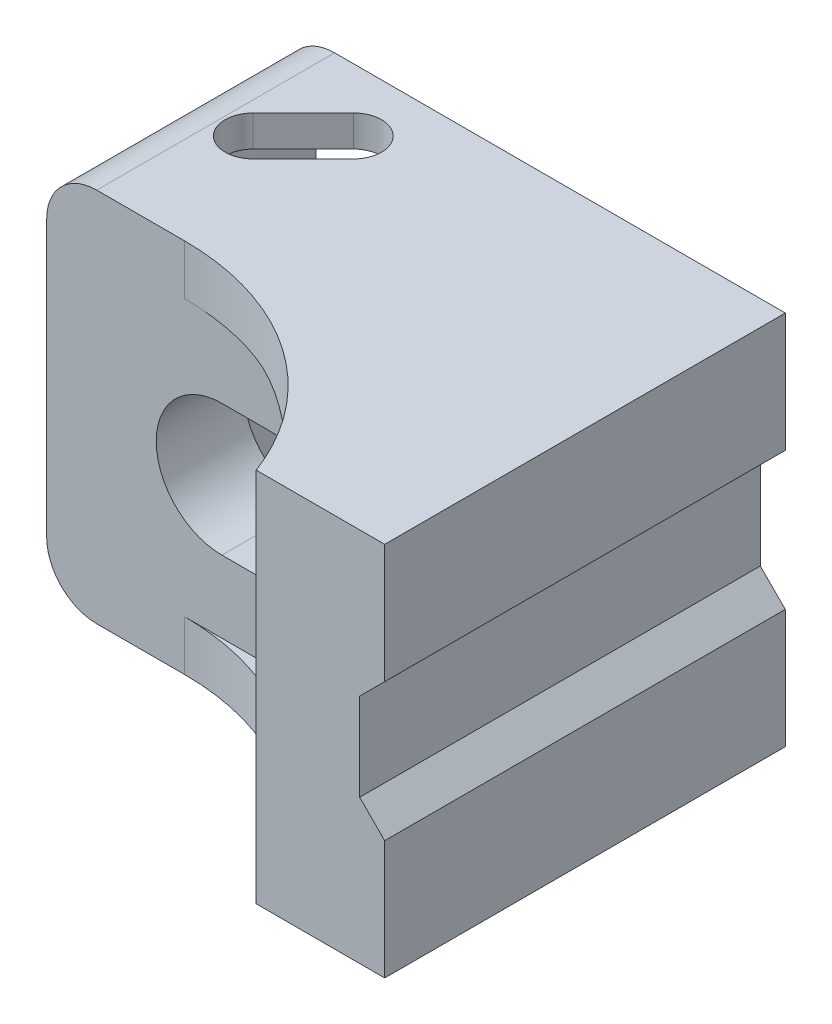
ISO-10303-21;
HEADER;
FILE_DESCRIPTION(('STEP AP214'),'2;1');
FILE_NAME('part.step','',(''),(''),'','','');
FILE_SCHEMA(('AUTOMOTIVE_DESIGN { 1 0 10303 214 1 1 1 1 }'));
ENDSEC;
DATA;
#1=APPLICATION_CONTEXT('core data for automotive mechanical design processes');
#2=APPLICATION_PROTOCOL_DEFINITION('international standard','automotive_design',2000,#1);
#3=PRODUCT_CONTEXT('',#1,'mechanical');
#4=PRODUCT('Part','Part','',(#3));
#5=PRODUCT_RELATED_PRODUCT_CATEGORY('part','',(#4));
#6=PRODUCT_DEFINITION_FORMATION('','',#4);
#7=PRODUCT_DEFINITION_CONTEXT('part definition',#1,'design');
#8=PRODUCT_DEFINITION('design','',#6,#7);
#9=PRODUCT_DEFINITION_SHAPE('','',#8);
#10=(LENGTH_UNIT() NAMED_UNIT(*) SI_UNIT(.MILLI.,.METRE.));
#11=(NAMED_UNIT(*) PLANE_ANGLE_UNIT() SI_UNIT($,.RADIAN.));
#12=(NAMED_UNIT(*) SI_UNIT($,.STERADIAN.) SOLID_ANGLE_UNIT());
#13=UNCERTAINTY_MEASURE_WITH_UNIT(LENGTH_MEASURE(1.E-05),#10,'distance_accuracy_value','');
#14=(GEOMETRIC_REPRESENTATION_CONTEXT(3) GLOBAL_UNCERTAINTY_ASSIGNED_CONTEXT((#13)) GLOBAL_UNIT_ASSIGNED_CONTEXT((#10,
#11,#12)) REPRESENTATION_CONTEXT('',''));
#15=CARTESIAN_POINT('',(0.,0.,0.));
#16=DIRECTION('',(0.,0.,1.));
#17=DIRECTION('',(1.,0.,0.));
#18=AXIS2_PLACEMENT_3D('',#15,#16,#17);
#19=CARTESIAN_POINT('',(22.,-15.,32.));
#20=DIRECTION('',(0.,1.,0.));
#21=DIRECTION('',(-1.,0.,0.));
#22=AXIS2_PLACEMENT_3D('',#19,#20,#21);
#23=PLANE('',#22);
#24=DIRECTION('',(1.,0.,0.));
#25=VECTOR('',#24,1.);
#26=CARTESIAN_POINT('',(-7.,-15.,19.));
#27=LINE('',#26,#25);
#28=CARTESIAN_POINT('',(-14.,-15.,19.));
#29=VERTEX_POINT('',#28);
#30=CARTESIAN_POINT('',(-7.,-15.,19.));
#31=VERTEX_POINT('',#30);
#32=EDGE_CURVE('E556',#29,#31,#27,.T.);
#33=ORIENTED_EDGE('',*,*,#32,.F.);
#34=DIRECTION('',(0.,0.,1.));
#35=VECTOR('',#34,1.);
#36=CARTESIAN_POINT('',(-14.,-15.,32.));
#37=LINE('',#36,#35);
#38=CARTESIAN_POINT('',(-14.,-15.,0.));
#39=VERTEX_POINT('',#38);
#40=EDGE_CURVE('E37',#29,#39,#37,.F.);
#41=ORIENTED_EDGE('',*,*,#40,.T.);
#42=DIRECTION('',(1.,0.,0.));
#43=VECTOR('',#42,1.);
#44=CARTESIAN_POINT('',(22.,-15.,0.));
#45=LINE('',#44,#43);
#46=CARTESIAN_POINT('',(22.,-15.,0.));
#47=VERTEX_POINT('',#46);
#48=EDGE_CURVE('E523',#39,#47,#45,.T.);
#49=ORIENTED_EDGE('',*,*,#48,.T.);
#50=DIRECTION('',(0.,0.,-1.));
#51=VECTOR('',#50,1.);
#52=CARTESIAN_POINT('',(22.,-15.,32.));
#53=LINE('',#52,#51);
#54=CARTESIAN_POINT('',(22.,-15.,32.));
#55=VERTEX_POINT('',#54);
#56=EDGE_CURVE('E711',#55,#47,#53,.T.);
#57=ORIENTED_EDGE('',*,*,#56,.F.);
#58=DIRECTION('',(1.,0.,0.));
#59=VECTOR('',#58,1.);
#60=CARTESIAN_POINT('',(22.,-15.,32.));
#61=LINE('',#60,#59);
#62=CARTESIAN_POINT('',(11.7349939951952,-15.,32.));
#63=VERTEX_POINT('',#62);
#64=EDGE_CURVE('E709',#63,#55,#61,.T.);
#65=ORIENTED_EDGE('',*,*,#64,.F.);
#66=CARTESIAN_POINT('',(-7.,-15.,39.));
#67=DIRECTION('',(0.,1.,0.));
#68=DIRECTION('',(-1.,0.,0.));
#69=AXIS2_PLACEMENT_3D('',#66,#67,#68);
#70=CIRCLE('',#69,20.);
#71=EDGE_CURVE('E414',#31,#63,#70,.F.);
#72=ORIENTED_EDGE('',*,*,#71,.F.);
#73=EDGE_LOOP('',(#33,#41,#49,#57,#65,#72));
#74=FACE_BOUND('',#73,.T.);
#75=CARTESIAN_POINT('',(-11.5,-15.,9.));
#76=DIRECTION('',(0.,1.,0.));
#77=DIRECTION('',(0.,0.,-1.));
#78=AXIS2_PLACEMENT_3D('',#75,#76,#77);
#79=CIRCLE('',#78,2.25);
#80=CARTESIAN_POINT('',(-13.0909902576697,-15.,7.40900974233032));
#81=VERTEX_POINT('',#80);
#82=CARTESIAN_POINT('',(-9.90900974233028,-15.,10.5909902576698));
#83=VERTEX_POINT('',#82);
#84=EDGE_CURVE('E288',#81,#83,#79,.T.);
#85=ORIENTED_EDGE('',*,*,#84,.T.);
#86=DIRECTION('',(0.707106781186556,0.,-0.70710678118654));
#87=VECTOR('',#86,1.);
#88=CARTESIAN_POINT('',(-9.90900974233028,-15.,10.5909902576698));
#89=LINE('',#88,#87);
#90=CARTESIAN_POINT('',(-5.90900974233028,-15.,6.59099025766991));
#91=VERTEX_POINT('',#90);
#92=EDGE_CURVE('E294',#83,#91,#89,.T.);
#93=ORIENTED_EDGE('',*,*,#92,.T.);
#94=CARTESIAN_POINT('',(-7.5,-15.,5.00000000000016));
#95=DIRECTION('',(0.,1.,0.));
#96=DIRECTION('',(0.,0.,-1.));
#97=AXIS2_PLACEMENT_3D('',#94,#95,#96);
#98=CIRCLE('',#97,2.25);
#99=CARTESIAN_POINT('',(-9.09099025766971,-15.,3.40900974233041));
#100=VERTEX_POINT('',#99);
#101=EDGE_CURVE('E314',#91,#100,#98,.T.);
#102=ORIENTED_EDGE('',*,*,#101,.T.);
#103=DIRECTION('',(-0.707106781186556,0.,0.70710678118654));
#104=VECTOR('',#103,1.);
#105=CARTESIAN_POINT('',(-13.0909902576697,-15.,7.40900974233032));
#106=LINE('',#105,#104);
#107=EDGE_CURVE('E306',#100,#81,#106,.T.);
#108=ORIENTED_EDGE('',*,*,#107,.T.);
#109=EDGE_LOOP('',(#85,#93,#102,#108));
#110=FACE_BOUND('',#109,.T.);
#111=ADVANCED_FACE('F14',(#74,#110),#23,.F.);
#112=CARTESIAN_POINT('',(-15.5,-12.5,0.));
#113=DIRECTION('',(0.,1.,0.));
#114=DIRECTION('',(0.,0.,-1.));
#115=AXIS2_PLACEMENT_3D('',#112,#113,#114);
#116=PLANE('',#115);
#117=DIRECTION('',(-1.,0.,0.));
#118=VECTOR('',#117,1.);
#119=CARTESIAN_POINT('',(-15.5,-12.5,0.));
#120=LINE('',#119,#118);
#121=CARTESIAN_POINT('',(19.4705627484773,-12.5,0.));
#122=VERTEX_POINT('',#121);
#123=CARTESIAN_POINT('',(-15.5,-12.5,0.));
#124=VERTEX_POINT('',#123);
#125=EDGE_CURVE('E726',#122,#124,#120,.T.);
#126=ORIENTED_EDGE('',*,*,#125,.T.);
#127=DIRECTION('',(0.,0.,1.));
#128=VECTOR('',#127,1.);
#129=CARTESIAN_POINT('',(-15.5,-12.5,14.));
#130=LINE('',#129,#128);
#131=CARTESIAN_POINT('',(-15.5,-12.5,14.));
#132=VERTEX_POINT('',#131);
#133=EDGE_CURVE('E722',#124,#132,#130,.T.);
#134=ORIENTED_EDGE('',*,*,#133,.T.);
#135=DIRECTION('',(1.,0.,0.));
#136=VECTOR('',#135,1.);
#137=CARTESIAN_POINT('',(-11.5,-12.5,14.));
#138=LINE('',#137,#136);
#139=CARTESIAN_POINT('',(-11.5,-12.5,14.));
#140=VERTEX_POINT('',#139);
#141=EDGE_CURVE('E725',#132,#140,#138,.T.);
#142=ORIENTED_EDGE('',*,*,#141,.T.);
#143=DIRECTION('',(0.707106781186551,0.,-0.707106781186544));
#144=VECTOR('',#143,1.);
#145=CARTESIAN_POINT('',(-4.5,-12.5,7.));
#146=LINE('',#145,#144);
#147=CARTESIAN_POINT('',(-4.5,-12.5,7.));
#148=VERTEX_POINT('',#147);
#149=EDGE_CURVE('E739',#140,#148,#146,.T.);
#150=ORIENTED_EDGE('',*,*,#149,.T.);
#151=DIRECTION('',(1.,0.,0.));
#152=VECTOR('',#151,1.);
#153=CARTESIAN_POINT('',(12.4705627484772,-12.5,7.));
#154=LINE('',#153,#152);
#155=CARTESIAN_POINT('',(12.4705627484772,-12.5,7.));
#156=VERTEX_POINT('',#155);
#157=EDGE_CURVE('E742',#148,#156,#154,.T.);
#158=ORIENTED_EDGE('',*,*,#157,.T.);
#159=DIRECTION('',(0.707106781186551,0.,-0.707106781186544));
#160=VECTOR('',#159,1.);
#161=CARTESIAN_POINT('',(19.4705627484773,-12.5,0.));
#162=LINE('',#161,#160);
#163=EDGE_CURVE('E631',#156,#122,#162,.T.);
#164=ORIENTED_EDGE('',*,*,#163,.T.);
#165=EDGE_LOOP('',(#126,#134,#142,#150,#158,#164));
#166=FACE_BOUND('',#165,.T.);
#167=DIRECTION('',(-0.707106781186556,0.,0.70710678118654));
#168=VECTOR('',#167,1.);
#169=CARTESIAN_POINT('',(-7.40900974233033,-12.5,8.09099025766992));
#170=LINE('',#169,#168);
#171=CARTESIAN_POINT('',(-5.90900974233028,-12.5,6.59099025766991));
#172=VERTEX_POINT('',#171);
#173=CARTESIAN_POINT('',(-9.90900974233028,-12.5,10.5909902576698));
#174=VERTEX_POINT('',#173);
#175=EDGE_CURVE('E323',#172,#174,#170,.T.);
#176=ORIENTED_EDGE('',*,*,#175,.T.);
#177=CARTESIAN_POINT('',(-11.5,-12.5,9.));
#178=DIRECTION('',(0.,1.,0.));
#179=DIRECTION('',(0.,0.,-1.));
#180=AXIS2_PLACEMENT_3D('',#177,#178,#179);
#181=CIRCLE('',#180,2.25);
#182=CARTESIAN_POINT('',(-13.0909902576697,-12.5,7.40900974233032));
#183=VERTEX_POINT('',#182);
#184=EDGE_CURVE('E291',#174,#183,#181,.F.);
#185=ORIENTED_EDGE('',*,*,#184,.T.);
#186=DIRECTION('',(0.707106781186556,0.,-0.70710678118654));
#187=VECTOR('',#186,1.);
#188=CARTESIAN_POINT('',(-10.5909902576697,-12.5,4.90900974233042));
#189=LINE('',#188,#187);
#190=CARTESIAN_POINT('',(-9.09099025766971,-12.5,3.40900974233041));
#191=VERTEX_POINT('',#190);
#192=EDGE_CURVE('E317',#183,#191,#189,.T.);
#193=ORIENTED_EDGE('',*,*,#192,.T.);
#194=CARTESIAN_POINT('',(-7.5,-12.5,5.00000000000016));
#195=DIRECTION('',(0.,1.,0.));
#196=DIRECTION('',(0.,0.,-1.));
#197=AXIS2_PLACEMENT_3D('',#194,#195,#196);
#198=CIRCLE('',#197,2.25);
#199=EDGE_CURVE('E320',#191,#172,#198,.F.);
#200=ORIENTED_EDGE('',*,*,#199,.T.);
#201=EDGE_LOOP('',(#176,#185,#193,#200));
#202=FACE_BOUND('',#201,.T.);
#203=ADVANCED_FACE('F486',(#166,#202),#116,.T.);
#204=CARTESIAN_POINT('',(22.,-15.,32.));
#205=DIRECTION('',(-1.,0.,0.));
#206=DIRECTION('',(0.,0.,-1.));
#207=AXIS2_PLACEMENT_3D('',#204,#205,#206);
#208=PLANE('',#207);
#209=DIRECTION('',(0.,1.,0.));
#210=VECTOR('',#209,1.);
#211=CARTESIAN_POINT('',(22.,-15.,32.));
#212=LINE('',#211,#210);
#213=CARTESIAN_POINT('',(22.,5.5,32.));
#214=VERTEX_POINT('',#213);
#215=CARTESIAN_POINT('',(22.,15.,32.));
#216=VERTEX_POINT('',#215);
#217=EDGE_CURVE('E702',#214,#216,#212,.T.);
#218=ORIENTED_EDGE('',*,*,#217,.F.);
#219=DIRECTION('',(0.,0.,1.));
#220=VECTOR('',#219,1.);
#221=CARTESIAN_POINT('',(22.,5.5,-4.99999999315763E-05));
#222=LINE('',#221,#220);
#223=CARTESIAN_POINT('',(22.,5.5,0.));
#224=VERTEX_POINT('',#223);
#225=EDGE_CURVE('E337',#224,#214,#222,.T.);
#226=ORIENTED_EDGE('',*,*,#225,.F.);
#227=DIRECTION('',(0.,1.,0.));
#228=VECTOR('',#227,1.);
#229=CARTESIAN_POINT('',(22.,-15.,0.));
#230=LINE('',#229,#228);
#231=CARTESIAN_POINT('',(22.,15.,0.));
#232=VERTEX_POINT('',#231);
#233=EDGE_CURVE('E696',#224,#232,#230,.T.);
#234=ORIENTED_EDGE('',*,*,#233,.T.);
#235=DIRECTION('',(0.,0.,-1.));
#236=VECTOR('',#235,1.);
#237=CARTESIAN_POINT('',(22.,15.,32.));
#238=LINE('',#237,#236);
#239=EDGE_CURVE('E521',#216,#232,#238,.T.);
#240=ORIENTED_EDGE('',*,*,#239,.F.);
#241=EDGE_LOOP('',(#218,#226,#234,#240));
#242=FACE_BOUND('',#241,.T.);
#243=ADVANCED_FACE('F492',(#242),#208,.F.);
#244=CARTESIAN_POINT('',(0.,0.,12.));
#245=DIRECTION('',(0.,0.,-1.));
#246=DIRECTION('',(1.,0.,0.));
#247=AXIS2_PLACEMENT_3D('',#244,#245,#246);
#248=CYLINDRICAL_SURFACE('',#247,7.25);
#249=DIRECTION('',(0.,0.,-1.));
#250=VECTOR('',#249,1.);
#251=CARTESIAN_POINT('',(6.20483682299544,3.75,12.));
#252=LINE('',#251,#250);
#253=CARTESIAN_POINT('',(6.20483682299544,3.75,12.));
#254=VERTEX_POINT('',#253);
#255=CARTESIAN_POINT('',(6.20483682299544,3.75,7.));
#256=VERTEX_POINT('',#255);
#257=EDGE_CURVE('E399',#254,#256,#252,.T.);
#258=ORIENTED_EDGE('',*,*,#257,.F.);
#259=CARTESIAN_POINT('',(0.,0.,12.));
#260=DIRECTION('',(0.,0.,-1.));
#261=DIRECTION('',(1.,0.,0.));
#262=AXIS2_PLACEMENT_3D('',#259,#260,#261);
#263=CIRCLE('',#262,7.25);
#264=CARTESIAN_POINT('',(0.,7.25,12.));
#265=VERTEX_POINT('',#264);
#266=EDGE_CURVE('E646',#265,#254,#263,.T.);
#267=ORIENTED_EDGE('',*,*,#266,.F.);
#268=DIRECTION('',(0.,0.,-1.));
#269=VECTOR('',#268,1.);
#270=CARTESIAN_POINT('',(0.,7.25,12.));
#271=LINE('',#270,#269);
#272=CARTESIAN_POINT('',(0.,7.25,7.));
#273=VERTEX_POINT('',#272);
#274=EDGE_CURVE('E652',#265,#273,#271,.T.);
#275=ORIENTED_EDGE('',*,*,#274,.T.);
#276=CARTESIAN_POINT('',(0.,0.,7.));
#277=DIRECTION('',(0.,0.,1.));
#278=DIRECTION('',(-1.,0.,0.));
#279=AXIS2_PLACEMENT_3D('',#276,#277,#278);
#280=CIRCLE('',#279,7.25);
#281=EDGE_CURVE('E718',#273,#256,#280,.F.);
#282=ORIENTED_EDGE('',*,*,#281,.T.);
#283=EDGE_LOOP('',(#258,#267,#275,#282));
#284=FACE_BOUND('',#283,.T.);
#285=ADVANCED_FACE('F784',(#284),#248,.F.);
#286=DIRECTION('',(0.,0.,-1.));
#287=VECTOR('',#286,1.);
#288=CARTESIAN_POINT('',(6.20483682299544,-3.75,12.));
#289=LINE('',#288,#287);
#290=CARTESIAN_POINT('',(6.20483682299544,-3.75,7.));
#291=VERTEX_POINT('',#290);
#292=CARTESIAN_POINT('',(6.20483682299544,-3.75,12.));
#293=VERTEX_POINT('',#292);
#294=EDGE_CURVE('E397',#291,#293,#289,.F.);
#295=ORIENTED_EDGE('',*,*,#294,.F.);
#296=CARTESIAN_POINT('',(0.,-7.25,7.));
#297=VERTEX_POINT('',#296);
#298=EDGE_CURVE('E717',#291,#297,#280,.F.);
#299=ORIENTED_EDGE('',*,*,#298,.T.);
#300=DIRECTION('',(0.,0.,-1.));
#301=VECTOR('',#300,1.);
#302=CARTESIAN_POINT('',(0.,-7.25,12.));
#303=LINE('',#302,#301);
#304=CARTESIAN_POINT('',(0.,-7.25,12.));
#305=VERTEX_POINT('',#304);
#306=EDGE_CURVE('E653',#305,#297,#303,.T.);
#307=ORIENTED_EDGE('',*,*,#306,.F.);
#308=EDGE_CURVE('E645',#293,#305,#263,.T.);
#309=ORIENTED_EDGE('',*,*,#308,.F.);
#310=EDGE_LOOP('',(#295,#299,#307,#309));
#311=FACE_BOUND('',#310,.T.);
#312=ADVANCED_FACE('F787',(#311),#248,.F.);
#313=CARTESIAN_POINT('',(12.4705627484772,-12.5,7.));
#314=DIRECTION('',(0.,0.,1.));
#315=DIRECTION('',(-1.,0.,0.));
#316=AXIS2_PLACEMENT_3D('',#313,#314,#315);
#317=PLANE('',#316);
#318=CARTESIAN_POINT('',(12.,0.,7.));
#319=DIRECTION('',(0.,0.,1.));
#320=DIRECTION('',(-1.,0.,0.));
#321=AXIS2_PLACEMENT_3D('',#318,#319,#320);
#322=CIRCLE('',#321,3.75);
#323=CARTESIAN_POINT('',(12.,3.75,7.));
#324=VERTEX_POINT('',#323);
#325=CARTESIAN_POINT('',(12.4705627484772,3.7203589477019,7.));
#326=VERTEX_POINT('',#325);
#327=EDGE_CURVE('E396',#324,#326,#322,.F.);
#328=ORIENTED_EDGE('',*,*,#327,.F.);
#329=DIRECTION('',(1.,0.,0.));
#330=VECTOR('',#329,1.);
#331=CARTESIAN_POINT('',(12.4705627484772,3.75,7.));
#332=LINE('',#331,#330);
#333=EDGE_CURVE('E596',#256,#324,#332,.T.);
#334=ORIENTED_EDGE('',*,*,#333,.F.);
#335=ORIENTED_EDGE('',*,*,#281,.F.);
#336=DIRECTION('',(1.,0.,0.));
#337=VECTOR('',#336,1.);
#338=CARTESIAN_POINT('',(-15.5,7.25,7.));
#339=LINE('',#338,#337);
#340=CARTESIAN_POINT('',(-4.5,7.25,7.));
#341=VERTEX_POINT('',#340);
#342=EDGE_CURVE('E635',#341,#273,#339,.T.);
#343=ORIENTED_EDGE('',*,*,#342,.F.);
#344=DIRECTION('',(0.,1.,0.));
#345=VECTOR('',#344,1.);
#346=CARTESIAN_POINT('',(-4.5,-12.5,7.));
#347=LINE('',#346,#345);
#348=CARTESIAN_POINT('',(-4.5,12.5,7.));
#349=VERTEX_POINT('',#348);
#350=EDGE_CURVE('E621',#341,#349,#347,.T.);
#351=ORIENTED_EDGE('',*,*,#350,.T.);
#352=DIRECTION('',(1.,0.,0.));
#353=VECTOR('',#352,1.);
#354=CARTESIAN_POINT('',(12.4705627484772,12.5,7.));
#355=LINE('',#354,#353);
#356=CARTESIAN_POINT('',(12.4705627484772,12.5,7.));
#357=VERTEX_POINT('',#356);
#358=EDGE_CURVE('E611',#349,#357,#355,.T.);
#359=ORIENTED_EDGE('',*,*,#358,.T.);
#360=DIRECTION('',(0.,1.,0.));
#361=VECTOR('',#360,1.);
#362=CARTESIAN_POINT('',(12.4705627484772,-12.5,7.));
#363=LINE('',#362,#361);
#364=EDGE_CURVE('E609',#326,#357,#363,.T.);
#365=ORIENTED_EDGE('',*,*,#364,.F.);
#366=EDGE_LOOP('',(#328,#334,#335,#343,#351,#359,#365));
#367=FACE_BOUND('',#366,.T.);
#368=ADVANCED_FACE('F607',(#367),#317,.F.);
#369=CARTESIAN_POINT('',(12.4705627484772,-3.7203589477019,7.));
#370=VERTEX_POINT('',#369);
#371=CARTESIAN_POINT('',(12.,-3.75,7.));
#372=VERTEX_POINT('',#371);
#373=EDGE_CURVE('E394',#370,#372,#322,.F.);
#374=ORIENTED_EDGE('',*,*,#373,.F.);
#375=EDGE_CURVE('E615',#156,#370,#363,.T.);
#376=ORIENTED_EDGE('',*,*,#375,.F.);
#377=ORIENTED_EDGE('',*,*,#157,.F.);
#378=CARTESIAN_POINT('',(-4.5,-7.25,7.));
#379=VERTEX_POINT('',#378);
#380=EDGE_CURVE('E616',#148,#379,#347,.T.);
#381=ORIENTED_EDGE('',*,*,#380,.T.);
#382=DIRECTION('',(-1.,0.,0.));
#383=VECTOR('',#382,1.);
#384=CARTESIAN_POINT('',(-15.5,-7.25,7.));
#385=LINE('',#384,#383);
#386=EDGE_CURVE('E632',#297,#379,#385,.T.);
#387=ORIENTED_EDGE('',*,*,#386,.F.);
#388=ORIENTED_EDGE('',*,*,#298,.F.);
#389=DIRECTION('',(-1.,0.,0.));
#390=VECTOR('',#389,1.);
#391=CARTESIAN_POINT('',(12.4705627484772,-3.75,7.));
#392=LINE('',#391,#390);
#393=EDGE_CURVE('E593',#372,#291,#392,.T.);
#394=ORIENTED_EDGE('',*,*,#393,.F.);
#395=EDGE_LOOP('',(#374,#376,#377,#381,#387,#388,#394));
#396=FACE_BOUND('',#395,.T.);
#397=ADVANCED_FACE('F825',(#396),#317,.F.);
#398=CARTESIAN_POINT('',(19.4705627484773,-12.5,0.));
#399=DIRECTION('',(0.707106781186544,0.,0.707106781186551));
#400=DIRECTION('',(-0.707106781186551,0.,0.707106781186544));
#401=AXIS2_PLACEMENT_3D('',#398,#399,#400);
#402=PLANE('',#401);
#403=CARTESIAN_POINT('',(12.,0.,7.47056274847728));
#404=DIRECTION('',(0.707106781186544,0.,0.707106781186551));
#405=DIRECTION('',(0.707106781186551,0.,-0.707106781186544));
#406=AXIS2_PLACEMENT_3D('',#403,#404,#405);
#407=ELLIPSE('',#406,5.30330085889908,3.75);
#408=EDGE_CURVE('E591',#326,#370,#407,.F.);
#409=ORIENTED_EDGE('',*,*,#408,.F.);
#410=ORIENTED_EDGE('',*,*,#364,.T.);
#411=DIRECTION('',(0.707106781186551,0.,-0.707106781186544));
#412=VECTOR('',#411,1.);
#413=CARTESIAN_POINT('',(19.4705627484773,12.5,0.));
#414=LINE('',#413,#412);
#415=CARTESIAN_POINT('',(19.4705627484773,12.5,0.));
#416=VERTEX_POINT('',#415);
#417=EDGE_CURVE('E729',#357,#416,#414,.T.);
#418=ORIENTED_EDGE('',*,*,#417,.T.);
#419=DIRECTION('',(0.,1.,0.));
#420=VECTOR('',#419,1.);
#421=CARTESIAN_POINT('',(19.4705627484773,-12.5,0.));
#422=LINE('',#421,#420);
#423=EDGE_CURVE('E619',#122,#416,#422,.T.);
#424=ORIENTED_EDGE('',*,*,#423,.F.);
#425=ORIENTED_EDGE('',*,*,#163,.F.);
#426=ORIENTED_EDGE('',*,*,#375,.T.);
#427=EDGE_LOOP('',(#409,#410,#418,#424,#425,#426));
#428=FACE_BOUND('',#427,.T.);
#429=ADVANCED_FACE('F820',(#428),#402,.F.);
#430=CARTESIAN_POINT('',(22.,15.,0.));
#431=DIRECTION('',(0.,0.,1.));
#432=DIRECTION('',(-1.,0.,0.));
#433=AXIS2_PLACEMENT_3D('',#430,#431,#432);
#434=PLANE('',#433);
#435=ORIENTED_EDGE('',*,*,#48,.F.);
#436=CARTESIAN_POINT('',(-14.,-11.,0.));
#437=DIRECTION('',(0.,0.,1.));
#438=DIRECTION('',(-1.,0.,0.));
#439=AXIS2_PLACEMENT_3D('',#436,#437,#438);
#440=CIRCLE('',#439,4.);
#441=CARTESIAN_POINT('',(-18.,-11.,0.));
#442=VERTEX_POINT('',#441);
#443=EDGE_CURVE('E22',#39,#442,#440,.F.);
#444=ORIENTED_EDGE('',*,*,#443,.T.);
#445=DIRECTION('',(0.,-1.,0.));
#446=VECTOR('',#445,1.);
#447=CARTESIAN_POINT('',(-18.,15.,0.));
#448=LINE('',#447,#446);
#449=CARTESIAN_POINT('',(-18.,11.,0.));
#450=VERTEX_POINT('',#449);
#451=EDGE_CURVE('E546',#450,#442,#448,.T.);
#452=ORIENTED_EDGE('',*,*,#451,.F.);
#453=CARTESIAN_POINT('',(-14.,11.,0.));
#454=DIRECTION('',(0.,0.,1.));
#455=DIRECTION('',(-1.,0.,0.));
#456=AXIS2_PLACEMENT_3D('',#453,#454,#455);
#457=CIRCLE('',#456,4.);
#458=CARTESIAN_POINT('',(-14.,15.,0.));
#459=VERTEX_POINT('',#458);
#460=EDGE_CURVE('E29',#450,#459,#457,.F.);
#461=ORIENTED_EDGE('',*,*,#460,.T.);
#462=DIRECTION('',(-1.,0.,0.));
#463=VECTOR('',#462,1.);
#464=CARTESIAN_POINT('',(22.,15.,0.));
#465=LINE('',#464,#463);
#466=EDGE_CURVE('E515',#232,#459,#465,.T.);
#467=ORIENTED_EDGE('',*,*,#466,.F.);
#468=ORIENTED_EDGE('',*,*,#233,.F.);
#469=DIRECTION('',(-0.707106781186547,-0.707106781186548,0.));
#470=VECTOR('',#469,1.);
#471=CARTESIAN_POINT('',(26.75,10.25,0.));
#472=LINE('',#471,#470);
#473=CARTESIAN_POINT('',(20.,3.5,0.));
#474=VERTEX_POINT('',#473);
#475=EDGE_CURVE('E346',#224,#474,#472,.T.);
#476=ORIENTED_EDGE('',*,*,#475,.T.);
#477=DIRECTION('',(0.,-1.,0.));
#478=VECTOR('',#477,1.);
#479=CARTESIAN_POINT('',(20.,15.,0.));
#480=LINE('',#479,#478);
#481=CARTESIAN_POINT('',(20.,-3.5,0.));
#482=VERTEX_POINT('',#481);
#483=EDGE_CURVE('E349',#474,#482,#480,.T.);
#484=ORIENTED_EDGE('',*,*,#483,.T.);
#485=DIRECTION('',(0.707106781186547,-0.707106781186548,0.));
#486=VECTOR('',#485,1.);
#487=CARTESIAN_POINT('',(11.75,4.75,0.));
#488=LINE('',#487,#486);
#489=CARTESIAN_POINT('',(22.,-5.5,0.));
#490=VERTEX_POINT('',#489);
#491=EDGE_CURVE('E336',#482,#490,#488,.T.);
#492=ORIENTED_EDGE('',*,*,#491,.T.);
#493=EDGE_CURVE('E524',#47,#490,#230,.T.);
#494=ORIENTED_EDGE('',*,*,#493,.F.);
#495=EDGE_LOOP('',(#435,#444,#452,#461,#467,#468,#476,#484,#492,#494));
#496=FACE_BOUND('',#495,.T.);
#497=ORIENTED_EDGE('',*,*,#125,.F.);
#498=ORIENTED_EDGE('',*,*,#423,.T.);
#499=DIRECTION('',(-1.,0.,0.));
#500=VECTOR('',#499,1.);
#501=CARTESIAN_POINT('',(-15.5,12.5,0.));
#502=LINE('',#501,#500);
#503=CARTESIAN_POINT('',(-15.5,12.5,0.));
#504=VERTEX_POINT('',#503);
#505=EDGE_CURVE('E551',#416,#504,#502,.T.);
#506=ORIENTED_EDGE('',*,*,#505,.T.);
#507=DIRECTION('',(0.,-1.,0.));
#508=VECTOR('',#507,1.);
#509=CARTESIAN_POINT('',(-15.5,15.,0.));
#510=LINE('',#509,#508);
#511=EDGE_CURVE('E552',#504,#124,#510,.T.);
#512=ORIENTED_EDGE('',*,*,#511,.T.);
#513=EDGE_LOOP('',(#497,#498,#506,#512));
#514=FACE_BOUND('',#513,.T.);
#515=ADVANCED_FACE('F544',(#496,#514),#434,.F.);
#516=CARTESIAN_POINT('',(-4.,0.,0.));
#517=DIRECTION('',(0.,0.,1.));
#518=DIRECTION('',(-1.,0.,0.));
#519=AXIS2_PLACEMENT_3D('',#516,#517,#518);
#520=CYLINDRICAL_SURFACE('',#519,5.25);
#521=CARTESIAN_POINT('',(-4.,0.,12.));
#522=DIRECTION('',(0.,0.,-1.));
#523=DIRECTION('',(1.,0.,0.));
#524=AXIS2_PLACEMENT_3D('',#521,#522,#523);
#525=CIRCLE('',#524,5.25);
#526=CARTESIAN_POINT('',(-4.,5.25,12.));
#527=VERTEX_POINT('',#526);
#528=CARTESIAN_POINT('',(-4.,-5.25,12.));
#529=VERTEX_POINT('',#528);
#530=EDGE_CURVE('E662',#527,#529,#525,.F.);
#531=ORIENTED_EDGE('',*,*,#530,.F.);
#532=DIRECTION('',(0.,0.,1.));
#533=VECTOR('',#532,1.);
#534=CARTESIAN_POINT('',(-4.,5.25,0.));
#535=LINE('',#534,#533);
#536=CARTESIAN_POINT('',(-4.,5.25,19.));
#537=VERTEX_POINT('',#536);
#538=EDGE_CURVE('E677',#527,#537,#535,.T.);
#539=ORIENTED_EDGE('',*,*,#538,.T.);
#540=CARTESIAN_POINT('',(-4.,0.,19.));
#541=DIRECTION('',(0.,0.,1.));
#542=DIRECTION('',(1.,0.,0.));
#543=AXIS2_PLACEMENT_3D('',#540,#541,#542);
#544=CIRCLE('',#543,5.25);
#545=CARTESIAN_POINT('',(-4.,-5.25,19.));
#546=VERTEX_POINT('',#545);
#547=EDGE_CURVE('E664',#537,#546,#544,.T.);
#548=ORIENTED_EDGE('',*,*,#547,.T.);
#549=DIRECTION('',(0.,0.,1.));
#550=VECTOR('',#549,1.);
#551=CARTESIAN_POINT('',(-4.,-5.25,0.));
#552=LINE('',#551,#550);
#553=EDGE_CURVE('E676',#529,#546,#552,.T.);
#554=ORIENTED_EDGE('',*,*,#553,.F.);
#555=EDGE_LOOP('',(#531,#539,#548,#554));
#556=FACE_BOUND('',#555,.T.);
#557=ADVANCED_FACE('F796',(#556),#520,.F.);
#558=CARTESIAN_POINT('',(-4.,5.25,0.));
#559=DIRECTION('',(0.,1.,0.));
#560=DIRECTION('',(0.,0.,-1.));
#561=AXIS2_PLACEMENT_3D('',#558,#559,#560);
#562=PLANE('',#561);
#563=DIRECTION('',(-1.,0.,0.));
#564=VECTOR('',#563,1.);
#565=CARTESIAN_POINT('',(-4.,5.25,12.));
#566=LINE('',#565,#564);
#567=CARTESIAN_POINT('',(0.,5.25,12.));
#568=VERTEX_POINT('',#567);
#569=EDGE_CURVE('E660',#568,#527,#566,.T.);
#570=ORIENTED_EDGE('',*,*,#569,.F.);
#571=DIRECTION('',(0.,0.,1.));
#572=VECTOR('',#571,1.);
#573=CARTESIAN_POINT('',(0.,5.25,0.));
#574=LINE('',#573,#572);
#575=CARTESIAN_POINT('',(0.,5.25,19.));
#576=VERTEX_POINT('',#575);
#577=EDGE_CURVE('E680',#568,#576,#574,.T.);
#578=ORIENTED_EDGE('',*,*,#577,.T.);
#579=DIRECTION('',(-1.,0.,0.));
#580=VECTOR('',#579,1.);
#581=CARTESIAN_POINT('',(-4.,5.25,19.));
#582=LINE('',#581,#580);
#583=EDGE_CURVE('E673',#576,#537,#582,.T.);
#584=ORIENTED_EDGE('',*,*,#583,.T.);
#585=ORIENTED_EDGE('',*,*,#538,.F.);
#586=EDGE_LOOP('',(#570,#578,#584,#585));
#587=FACE_BOUND('',#586,.T.);
#588=ADVANCED_FACE('F792',(#587),#562,.F.);
#589=CARTESIAN_POINT('',(0.,0.,0.));
#590=DIRECTION('',(0.,0.,1.));
#591=DIRECTION('',(-1.,0.,0.));
#592=AXIS2_PLACEMENT_3D('',#589,#590,#591);
#593=CYLINDRICAL_SURFACE('',#592,5.25);
#594=CARTESIAN_POINT('',(0.,0.,12.));
#595=DIRECTION('',(0.,0.,-1.));
#596=DIRECTION('',(1.,0.,0.));
#597=AXIS2_PLACEMENT_3D('',#594,#595,#596);
#598=CIRCLE('',#597,5.25);
#599=CARTESIAN_POINT('',(0.,-5.25,12.));
#600=VERTEX_POINT('',#599);
#601=EDGE_CURVE('E656',#600,#568,#598,.F.);
#602=ORIENTED_EDGE('',*,*,#601,.F.);
#603=DIRECTION('',(0.,0.,1.));
#604=VECTOR('',#603,1.);
#605=CARTESIAN_POINT('',(0.,-5.25,0.));
#606=LINE('',#605,#604);
#607=CARTESIAN_POINT('',(0.,-5.25,19.));
#608=VERTEX_POINT('',#607);
#609=EDGE_CURVE('E682',#600,#608,#606,.T.);
#610=ORIENTED_EDGE('',*,*,#609,.T.);
#611=CARTESIAN_POINT('',(0.,0.,19.));
#612=DIRECTION('',(0.,0.,1.));
#613=DIRECTION('',(-1.,0.,0.));
#614=AXIS2_PLACEMENT_3D('',#611,#612,#613);
#615=CIRCLE('',#614,5.25);
#616=EDGE_CURVE('E670',#608,#576,#615,.T.);
#617=ORIENTED_EDGE('',*,*,#616,.T.);
#618=ORIENTED_EDGE('',*,*,#577,.F.);
#619=EDGE_LOOP('',(#602,#610,#617,#618));
#620=FACE_BOUND('',#619,.T.);
#621=ADVANCED_FACE('F795',(#620),#593,.F.);
#622=CARTESIAN_POINT('',(-4.,-5.25,0.));
#623=DIRECTION('',(0.,-1.,0.));
#624=DIRECTION('',(0.,0.,1.));
#625=AXIS2_PLACEMENT_3D('',#622,#623,#624);
#626=PLANE('',#625);
#627=DIRECTION('',(1.,0.,0.));
#628=VECTOR('',#627,1.);
#629=CARTESIAN_POINT('',(-4.,-5.25,12.));
#630=LINE('',#629,#628);
#631=EDGE_CURVE('E715',#529,#600,#630,.T.);
#632=ORIENTED_EDGE('',*,*,#631,.F.);
#633=ORIENTED_EDGE('',*,*,#553,.T.);
#634=DIRECTION('',(1.,0.,0.));
#635=VECTOR('',#634,1.);
#636=CARTESIAN_POINT('',(-4.,-5.25,19.));
#637=LINE('',#636,#635);
#638=EDGE_CURVE('E667',#546,#608,#637,.T.);
#639=ORIENTED_EDGE('',*,*,#638,.T.);
#640=ORIENTED_EDGE('',*,*,#609,.F.);
#641=EDGE_LOOP('',(#632,#633,#639,#640));
#642=FACE_BOUND('',#641,.T.);
#643=ADVANCED_FACE('F508',(#642),#626,.F.);
#644=ORIENTED_EDGE('',*,*,#493,.T.);
#645=DIRECTION('',(0.,0.,1.));
#646=VECTOR('',#645,1.);
#647=CARTESIAN_POINT('',(22.,-5.5,-4.99999999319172E-05));
#648=LINE('',#647,#646);
#649=CARTESIAN_POINT('',(22.,-5.5,32.));
#650=VERTEX_POINT('',#649);
#651=EDGE_CURVE('E339',#490,#650,#648,.T.);
#652=ORIENTED_EDGE('',*,*,#651,.T.);
#653=EDGE_CURVE('E703',#55,#650,#212,.T.);
#654=ORIENTED_EDGE('',*,*,#653,.F.);
#655=ORIENTED_EDGE('',*,*,#56,.T.);
#656=EDGE_LOOP('',(#644,#652,#654,#655));
#657=FACE_BOUND('',#656,.T.);
#658=ADVANCED_FACE('F16',(#657),#208,.F.);
#659=CARTESIAN_POINT('',(22.,15.,32.));
#660=DIRECTION('',(0.,-1.,0.));
#661=DIRECTION('',(1.,0.,0.));
#662=AXIS2_PLACEMENT_3D('',#659,#660,#661);
#663=PLANE('',#662);
#664=DIRECTION('',(0.707106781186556,0.,-0.70710678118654));
#665=VECTOR('',#664,1.);
#666=CARTESIAN_POINT('',(-9.90900974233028,15.,10.5909902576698));
#667=LINE('',#666,#665);
#668=CARTESIAN_POINT('',(-9.90900974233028,15.,10.5909902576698));
#669=VERTEX_POINT('',#668);
#670=CARTESIAN_POINT('',(-5.90900974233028,15.,6.59099025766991));
#671=VERTEX_POINT('',#670);
#672=EDGE_CURVE('E363',#669,#671,#667,.T.);
#673=ORIENTED_EDGE('',*,*,#672,.F.);
#674=CARTESIAN_POINT('',(-11.5,15.,9.));
#675=DIRECTION('',(0.,1.,0.));
#676=DIRECTION('',(0.,0.,-1.));
#677=AXIS2_PLACEMENT_3D('',#674,#675,#676);
#678=CIRCLE('',#677,2.25);
#679=CARTESIAN_POINT('',(-13.0909902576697,15.,7.40900974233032));
#680=VERTEX_POINT('',#679);
#681=EDGE_CURVE('E352',#680,#669,#678,.T.);
#682=ORIENTED_EDGE('',*,*,#681,.F.);
#683=DIRECTION('',(-0.707106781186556,0.,0.70710678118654));
#684=VECTOR('',#683,1.);
#685=CARTESIAN_POINT('',(-13.0909902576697,15.,7.40900974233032));
#686=LINE('',#685,#684);
#687=CARTESIAN_POINT('',(-9.0909902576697,15.,3.40900974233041));
#688=VERTEX_POINT('',#687);
#689=EDGE_CURVE('E369',#688,#680,#686,.T.);
#690=ORIENTED_EDGE('',*,*,#689,.F.);
#691=CARTESIAN_POINT('',(-7.5,15.,5.00000000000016));
#692=DIRECTION('',(0.,1.,0.));
#693=DIRECTION('',(0.,0.,-1.));
#694=AXIS2_PLACEMENT_3D('',#691,#692,#693);
#695=CIRCLE('',#694,2.25);
#696=EDGE_CURVE('E366',#671,#688,#695,.T.);
#697=ORIENTED_EDGE('',*,*,#696,.F.);
#698=EDGE_LOOP('',(#673,#682,#690,#697));
#699=FACE_BOUND('',#698,.T.);
#700=ORIENTED_EDGE('',*,*,#466,.T.);
#701=DIRECTION('',(0.,0.,-1.));
#702=VECTOR('',#701,1.);
#703=CARTESIAN_POINT('',(-14.,15.,32.));
#704=LINE('',#703,#702);
#705=CARTESIAN_POINT('',(-14.,15.,19.));
#706=VERTEX_POINT('',#705);
#707=EDGE_CURVE('E9',#459,#706,#704,.F.);
#708=ORIENTED_EDGE('',*,*,#707,.T.);
#709=DIRECTION('',(-1.,0.,0.));
#710=VECTOR('',#709,1.);
#711=CARTESIAN_POINT('',(-7.,15.,19.));
#712=LINE('',#711,#710);
#713=CARTESIAN_POINT('',(-7.,15.,19.));
#714=VERTEX_POINT('',#713);
#715=EDGE_CURVE('E563',#714,#706,#712,.T.);
#716=ORIENTED_EDGE('',*,*,#715,.F.);
#717=CARTESIAN_POINT('',(-7.,15.,39.));
#718=DIRECTION('',(0.,1.,0.));
#719=DIRECTION('',(0.,0.,-1.));
#720=AXIS2_PLACEMENT_3D('',#717,#718,#719);
#721=CIRCLE('',#720,20.);
#722=CARTESIAN_POINT('',(11.7349939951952,15.,32.));
#723=VERTEX_POINT('',#722);
#724=EDGE_CURVE('E561',#723,#714,#721,.T.);
#725=ORIENTED_EDGE('',*,*,#724,.F.);
#726=DIRECTION('',(-1.,0.,0.));
#727=VECTOR('',#726,1.);
#728=CARTESIAN_POINT('',(22.,15.,32.));
#729=LINE('',#728,#727);
#730=EDGE_CURVE('E706',#216,#723,#729,.T.);
#731=ORIENTED_EDGE('',*,*,#730,.F.);
#732=ORIENTED_EDGE('',*,*,#239,.T.);
#733=EDGE_LOOP('',(#700,#708,#716,#725,#731,#732));
#734=FACE_BOUND('',#733,.T.);
#735=ADVANCED_FACE('F498',(#699,#734),#663,.F.);
#736=CARTESIAN_POINT('',(22.,15.,32.));
#737=DIRECTION('',(0.,0.,1.));
#738=DIRECTION('',(-1.,0.,0.));
#739=AXIS2_PLACEMENT_3D('',#736,#737,#738);
#740=PLANE('',#739);
#741=DIRECTION('',(-0.707106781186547,-0.707106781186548,0.));
#742=VECTOR('',#741,1.);
#743=CARTESIAN_POINT('',(20.,3.5,32.));
#744=LINE('',#743,#742);
#745=CARTESIAN_POINT('',(20.,3.5,32.));
#746=VERTEX_POINT('',#745);
#747=EDGE_CURVE('E330',#214,#746,#744,.T.);
#748=ORIENTED_EDGE('',*,*,#747,.F.);
#749=ORIENTED_EDGE('',*,*,#217,.T.);
#750=ORIENTED_EDGE('',*,*,#730,.T.);
#751=DIRECTION('',(0.,1.,0.));
#752=VECTOR('',#751,1.);
#753=CARTESIAN_POINT('',(11.7349939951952,-15.001,32.));
#754=LINE('',#753,#752);
#755=EDGE_CURVE('E567',#63,#723,#754,.T.);
#756=ORIENTED_EDGE('',*,*,#755,.F.);
#757=ORIENTED_EDGE('',*,*,#64,.T.);
#758=ORIENTED_EDGE('',*,*,#653,.T.);
#759=DIRECTION('',(0.707106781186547,-0.707106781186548,0.));
#760=VECTOR('',#759,1.);
#761=CARTESIAN_POINT('',(20.,-3.5,32.));
#762=LINE('',#761,#760);
#763=CARTESIAN_POINT('',(20.,-3.5,32.));
#764=VERTEX_POINT('',#763);
#765=EDGE_CURVE('E328',#764,#650,#762,.T.);
#766=ORIENTED_EDGE('',*,*,#765,.F.);
#767=DIRECTION('',(0.,-1.,0.));
#768=VECTOR('',#767,1.);
#769=CARTESIAN_POINT('',(20.,3.5,32.));
#770=LINE('',#769,#768);
#771=EDGE_CURVE('E326',#746,#764,#770,.T.);
#772=ORIENTED_EDGE('',*,*,#771,.F.);
#773=EDGE_LOOP('',(#748,#749,#750,#756,#757,#758,#766,#772));
#774=FACE_BOUND('',#773,.T.);
#775=ADVANCED_FACE('F496',(#774),#740,.T.);
#776=CARTESIAN_POINT('',(0.,0.,19.));
#777=DIRECTION('',(0.,0.,1.));
#778=DIRECTION('',(-1.,0.,0.));
#779=AXIS2_PLACEMENT_3D('',#776,#777,#778);
#780=CYLINDRICAL_SURFACE('',#779,11.);
#781=DIRECTION('',(0.,0.,1.));
#782=VECTOR('',#781,1.);
#783=CARTESIAN_POINT('',(0.,-11.,19.));
#784=LINE('',#783,#782);
#785=CARTESIAN_POINT('',(0.,-11.,19.));
#786=VERTEX_POINT('',#785);
#787=CARTESIAN_POINT('',(0.,-11.,20.2650060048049));
#788=VERTEX_POINT('',#787);
#789=EDGE_CURVE('E693',#786,#788,#784,.T.);
#790=ORIENTED_EDGE('',*,*,#789,.T.);
#791=CARTESIAN_POINT('',(0.,11.,20.2650060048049));
#792=CARTESIAN_POINT('',(0.162369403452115,11.0000008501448,20.3256693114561));
#793=CARTESIAN_POINT('',(0.323916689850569,10.9964044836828,20.3884378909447));
#794=CARTESIAN_POINT('',(0.645041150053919,10.9822469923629,20.5180276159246));
#795=CARTESIAN_POINT('',(0.804618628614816,10.9716869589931,20.5848481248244));
#796=CARTESIAN_POINT('',(1.27951320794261,10.9299453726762,20.7909759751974));
#797=CARTESIAN_POINT('',(1.59147625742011,10.8887009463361,20.9361306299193));
#798=CARTESIAN_POINT('',(2.20141078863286,10.7818785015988,21.2391128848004));
#799=CARTESIAN_POINT('',(2.49947825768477,10.7165091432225,21.3968229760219));
#800=CARTESIAN_POINT('',(3.08299777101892,10.5634335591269,21.7244351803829));
#801=CARTESIAN_POINT('',(3.36844586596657,10.4757203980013,21.8943410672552));
#802=CARTESIAN_POINT('',(3.92406337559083,10.2804669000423,22.2437473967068));
#803=CARTESIAN_POINT('',(4.19430505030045,10.1730329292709,22.4231928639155));
#804=CARTESIAN_POINT('',(4.72041888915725,9.93984098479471,22.7909042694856));
#805=CARTESIAN_POINT('',(4.97629224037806,9.81408452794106,22.9791694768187));
#806=CARTESIAN_POINT('',(5.47397247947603,9.54546009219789,23.3635319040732));
#807=CARTESIAN_POINT('',(5.71573985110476,9.40254717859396,23.5596487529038));
#808=CARTESIAN_POINT('',(6.18430858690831,9.10120506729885,23.9577744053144));
#809=CARTESIAN_POINT('',(6.41110786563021,8.94277371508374,24.1597840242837));
#810=CARTESIAN_POINT('',(6.89575681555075,8.57666394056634,24.6111364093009));
#811=CARTESIAN_POINT('',(7.15012070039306,8.36563167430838,24.8615078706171));
#812=CARTESIAN_POINT('',(7.63693096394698,7.9237238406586,25.3661019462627));
#813=CARTESIAN_POINT('',(7.86937247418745,7.69284388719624,25.6203254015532));
#814=CARTESIAN_POINT('',(8.31225529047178,7.21201850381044,26.1295442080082));
#815=CARTESIAN_POINT('',(8.52270759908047,6.96208271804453,26.3845391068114));
#816=CARTESIAN_POINT('',(8.92165098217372,6.44292954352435,26.8919434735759));
#817=CARTESIAN_POINT('',(9.11014913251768,6.17371841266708,27.144353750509));
#818=CARTESIAN_POINT('',(9.40173697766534,5.71425847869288,27.5535220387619));
#819=CARTESIAN_POINT('',(9.51135774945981,5.52998277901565,27.7123689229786));
#820=CARTESIAN_POINT('',(9.72110095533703,5.15236397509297,28.025472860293));
#821=CARTESIAN_POINT('',(9.8212249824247,4.95902239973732,28.1797306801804));
#822=CARTESIAN_POINT('',(10.011565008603,4.56255526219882,28.4815176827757));
#823=CARTESIAN_POINT('',(10.1017845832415,4.3594332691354,28.6290492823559));
#824=CARTESIAN_POINT('',(10.2717217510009,3.94238819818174,28.9146054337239));
#825=CARTESIAN_POINT('',(10.3514425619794,3.7284684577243,29.0526328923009));
#826=CARTESIAN_POINT('',(10.4768660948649,3.35578006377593,29.2752804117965));
#827=CARTESIAN_POINT('',(10.5255314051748,3.20007422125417,29.3633562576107));
#828=CARTESIAN_POINT('',(10.616884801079,2.88254338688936,29.5313935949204));
#829=CARTESIAN_POINT('',(10.6595713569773,2.72071684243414,29.6113530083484));
#830=CARTESIAN_POINT('',(10.7383042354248,2.39112433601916,29.760968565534));
#831=CARTESIAN_POINT('',(10.7743622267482,2.22336944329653,29.8306427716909));
#832=CARTESIAN_POINT('',(10.8392162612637,1.88189851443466,29.9574647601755));
#833=CARTESIAN_POINT('',(10.8680179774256,1.70818725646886,30.014622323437));
#834=CARTESIAN_POINT('',(10.9117938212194,1.39689706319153,30.1022784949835));
#835=CARTESIAN_POINT('',(10.9284268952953,1.26042625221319,30.1358854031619));
#836=CARTESIAN_POINT('',(10.9566870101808,0.984966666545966,30.1932742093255));
#837=CARTESIAN_POINT('',(10.9683165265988,0.845979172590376,30.217060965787));
#838=CARTESIAN_POINT('',(10.9863010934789,0.566382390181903,30.253949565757));
#839=CARTESIAN_POINT('',(10.9926613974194,0.425774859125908,30.2670620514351));
#840=CARTESIAN_POINT('',(10.9999638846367,0.143815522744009,30.2821234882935));
#841=CARTESIAN_POINT('',(11.0009060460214,0.00246371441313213,30.2840723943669));
#842=CARTESIAN_POINT('',(10.9973438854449,-0.27995236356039,30.2767188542));
#843=CARTESIAN_POINT('',(10.9928367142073,-0.421016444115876,30.2674105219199));
#844=CARTESIAN_POINT('',(10.978494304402,-0.701753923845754,30.2379232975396));
#845=CARTESIAN_POINT('',(10.9686570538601,-0.841426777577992,30.2177403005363));
#846=CARTESIAN_POINT('',(10.9314600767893,-1.25716062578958,30.1418933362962));
#847=CARTESIAN_POINT('',(10.89641702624,-1.52981099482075,30.0709357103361));
#848=CARTESIAN_POINT('',(10.7863476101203,-2.19530583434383,29.8530500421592));
#849=CARTESIAN_POINT('',(10.700071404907,-2.57947905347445,29.6858575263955));
#850=CARTESIAN_POINT('',(10.5466557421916,-3.13125608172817,29.4017325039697));
#851=CARTESIAN_POINT('',(10.4913714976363,-3.31146362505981,29.3012148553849));
#852=CARTESIAN_POINT('',(10.3734166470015,-3.66425251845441,29.0914766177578));
#853=CARTESIAN_POINT('',(10.3107475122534,-3.83683537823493,28.9822577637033));
#854=CARTESIAN_POINT('',(10.1207150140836,-4.32286993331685,28.658782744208));
#855=CARTESIAN_POINT('',(9.98472989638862,-4.62743148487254,28.4362484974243));
#856=CARTESIAN_POINT('',(9.69076166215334,-5.21507997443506,27.9776154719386));
#857=CARTESIAN_POINT('',(9.53276018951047,-5.49814868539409,27.7415054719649));
#858=CARTESIAN_POINT('',(9.19558391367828,-6.0452098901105,27.2616362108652));
#859=CARTESIAN_POINT('',(9.01638253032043,-6.30917775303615,27.0178676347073));
#860=CARTESIAN_POINT('',(8.63744332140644,-6.81874793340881,26.5273719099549));
#861=CARTESIAN_POINT('',(8.43771161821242,-7.06435568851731,26.2806456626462));
#862=CARTESIAN_POINT('',(7.99984373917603,-7.55780214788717,25.7663971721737));
#863=CARTESIAN_POINT('',(7.75988535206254,-7.80404795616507,25.4988941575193));
#864=CARTESIAN_POINT('',(7.25569862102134,-8.27488975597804,24.9675647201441));
#865=CARTESIAN_POINT('',(6.99146582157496,-8.49948175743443,24.7037389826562));
#866=CARTESIAN_POINT('',(6.43898938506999,-8.92529580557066,24.1832033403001));
#867=CARTESIAN_POINT('',(6.15077309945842,-9.12654386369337,23.9264857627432));
#868=CARTESIAN_POINT('',(5.55021549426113,-9.50372360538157,23.4229157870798));
#869=CARTESIAN_POINT('',(5.23788148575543,-9.67966291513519,23.1760604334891));
#870=CARTESIAN_POINT('',(4.65595710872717,-9.97020899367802,22.7444869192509));
#871=CARTESIAN_POINT('',(4.39070718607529,-10.0899979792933,22.5573942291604));
#872=CARTESIAN_POINT('',(3.84572374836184,-10.3100315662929,22.1929269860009));
#873=CARTESIAN_POINT('',(3.56598953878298,-10.4102752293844,22.015552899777));
#874=CARTESIAN_POINT('',(2.99366427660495,-10.5890329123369,21.6726322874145));
#875=CARTESIAN_POINT('',(2.70110767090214,-10.6676014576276,21.507056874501));
#876=CARTESIAN_POINT('',(2.10391473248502,-10.801254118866,21.1889613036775));
#877=CARTESIAN_POINT('',(1.79928496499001,-10.8563508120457,21.0364341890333));
#878=CARTESIAN_POINT('',(1.24687109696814,-10.9318463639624,20.7774622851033));
#879=CARTESIAN_POINT('',(1.00107761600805,-10.9571775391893,20.6681950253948));
#880=CARTESIAN_POINT('',(0.504196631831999,-10.9912654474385,20.4592342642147));
#881=CARTESIAN_POINT('',(0.253106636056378,-11.0000141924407,20.359545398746));
#882=CARTESIAN_POINT('',(0.,-11.,20.2650060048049));
#883=B_SPLINE_CURVE_WITH_KNOTS('',3,(#791,#792,#793,#794,#795,#796,#797,#798,#799,#800,#801,
#802,#803,#804,#805,#806,#807,#808,#809,#810,#811,#812,#813,#814,#815,#816,#817,#818,#819,#820,
#821,#822,#823,#824,#825,#826,#827,#828,#829,#830,#831,#832,#833,#834,#835,#836,#837,#838,#839,
#840,#841,#842,#843,#844,#845,#846,#847,#848,#849,#850,#851,#852,#853,#854,#855,#856,#857,#858,
#859,#860,#861,#862,#863,#864,#865,#866,#867,#868,#869,#870,#871,#872,#873,#874,#875,#876,#877,
#878,#879,#880,#881,#882),.UNSPECIFIED.,.F.,.F.,(4,2,2,2,2,2,2,2,2,2,2,2,2,2,2,2,2,2,2,2,2,2,2,
2,2,2,2,2,2,2,2,2,2,2,2,2,2,2,2,2,2,2,2,2,2,4),(0.,0.519881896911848,1.03968232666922,
2.07773979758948,3.10702169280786,4.1366234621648,5.16082697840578,6.18494575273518,
7.21180786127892,8.23881273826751,9.48156093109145,10.7245844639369,11.9669830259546,
13.2089800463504,14.0092126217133,14.8093107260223,15.6091190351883,16.4086816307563,
16.9645474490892,17.5205552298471,18.075574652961,18.6301588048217,19.0543424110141,
19.4783159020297,19.9018661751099,20.3254181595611,20.749191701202,21.1731253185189,
22.0213656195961,23.297072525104,23.9376976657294,24.5781953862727,25.7791946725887,
26.9812013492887,28.1847313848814,29.3879035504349,30.6935889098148,31.9995144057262,
33.3039704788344,34.6080326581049,35.6451131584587,36.6822434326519,37.7167404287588,
38.7506823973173,39.5605141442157,40.3707359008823),.UNSPECIFIED.);
#884=CARTESIAN_POINT('',(0.,11.,20.2650060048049));
#885=VERTEX_POINT('',#884);
#886=EDGE_CURVE('E406',#885,#788,#883,.T.);
#887=ORIENTED_EDGE('',*,*,#886,.F.);
#888=DIRECTION('',(0.,0.,1.));
#889=VECTOR('',#888,1.);
#890=CARTESIAN_POINT('',(0.,11.,19.));
#891=LINE('',#890,#889);
#892=CARTESIAN_POINT('',(0.,11.,19.));
#893=VERTEX_POINT('',#892);
#894=EDGE_CURVE('E692',#893,#885,#891,.T.);
#895=ORIENTED_EDGE('',*,*,#894,.F.);
#896=CARTESIAN_POINT('',(0.,0.,19.));
#897=DIRECTION('',(0.,0.,1.));
#898=DIRECTION('',(-1.,0.,0.));
#899=AXIS2_PLACEMENT_3D('',#896,#897,#898);
#900=CIRCLE('',#899,11.);
#901=EDGE_CURVE('E679',#786,#893,#900,.T.);
#902=ORIENTED_EDGE('',*,*,#901,.F.);
#903=EDGE_LOOP('',(#790,#887,#895,#902));
#904=FACE_BOUND('',#903,.T.);
#905=ADVANCED_FACE('F506',(#904),#780,.F.);
#906=CARTESIAN_POINT('',(0.,-11.,19.));
#907=DIRECTION('',(0.,-1.,0.));
#908=DIRECTION('',(0.,0.,1.));
#909=AXIS2_PLACEMENT_3D('',#906,#907,#908);
#910=PLANE('',#909);
#911=DIRECTION('',(1.,0.,0.));
#912=VECTOR('',#911,1.);
#913=CARTESIAN_POINT('',(0.,-11.,19.));
#914=LINE('',#913,#912);
#915=CARTESIAN_POINT('',(-7.,-11.,19.));
#916=VERTEX_POINT('',#915);
#917=EDGE_CURVE('E690',#916,#786,#914,.T.);
#918=ORIENTED_EDGE('',*,*,#917,.F.);
#919=CARTESIAN_POINT('',(-7.,-11.,39.));
#920=DIRECTION('',(0.,-1.,0.));
#921=DIRECTION('',(0.,0.,1.));
#922=AXIS2_PLACEMENT_3D('',#919,#920,#921);
#923=CIRCLE('',#922,20.);
#924=EDGE_CURVE('E403',#788,#916,#923,.F.);
#925=ORIENTED_EDGE('',*,*,#924,.F.);
#926=ORIENTED_EDGE('',*,*,#789,.F.);
#927=EDGE_LOOP('',(#918,#925,#926));
#928=FACE_BOUND('',#927,.T.);
#929=ADVANCED_FACE('F810',(#928),#910,.F.);
#930=CARTESIAN_POINT('',(0.,11.,19.));
#931=DIRECTION('',(0.,1.,0.));
#932=DIRECTION('',(0.,0.,-1.));
#933=AXIS2_PLACEMENT_3D('',#930,#931,#932);
#934=PLANE('',#933);
#935=ORIENTED_EDGE('',*,*,#894,.T.);
#936=CARTESIAN_POINT('',(-7.,11.,39.));
#937=DIRECTION('',(0.,1.,0.));
#938=DIRECTION('',(0.,0.,-1.));
#939=AXIS2_PLACEMENT_3D('',#936,#937,#938);
#940=CIRCLE('',#939,20.);
#941=CARTESIAN_POINT('',(-7.,11.,19.));
#942=VERTEX_POINT('',#941);
#943=EDGE_CURVE('E401',#942,#885,#940,.F.);
#944=ORIENTED_EDGE('',*,*,#943,.F.);
#945=DIRECTION('',(-1.,0.,0.));
#946=VECTOR('',#945,1.);
#947=CARTESIAN_POINT('',(0.,11.,19.));
#948=LINE('',#947,#946);
#949=EDGE_CURVE('E687',#893,#942,#948,.T.);
#950=ORIENTED_EDGE('',*,*,#949,.F.);
#951=EDGE_LOOP('',(#935,#944,#950));
#952=FACE_BOUND('',#951,.T.);
#953=ADVANCED_FACE('F809',(#952),#934,.F.);
#954=CARTESIAN_POINT('',(0.,0.,19.));
#955=DIRECTION('',(0.,0.,1.));
#956=DIRECTION('',(-1.,0.,0.));
#957=AXIS2_PLACEMENT_3D('',#954,#955,#956);
#958=PLANE('',#957);
#959=DIRECTION('',(0.,1.,0.));
#960=VECTOR('',#959,1.);
#961=CARTESIAN_POINT('',(-18.,-15.001,19.));
#962=LINE('',#961,#960);
#963=CARTESIAN_POINT('',(-18.,-11.,19.));
#964=VERTEX_POINT('',#963);
#965=CARTESIAN_POINT('',(-18.,11.,19.));
#966=VERTEX_POINT('',#965);
#967=EDGE_CURVE('E558',#964,#966,#962,.T.);
#968=ORIENTED_EDGE('',*,*,#967,.F.);
#969=CARTESIAN_POINT('',(-14.,-11.,19.));
#970=DIRECTION('',(0.,0.,1.));
#971=DIRECTION('',(-1.,0.,0.));
#972=AXIS2_PLACEMENT_3D('',#969,#970,#971);
#973=CIRCLE('',#972,4.);
#974=EDGE_CURVE('E533',#964,#29,#973,.T.);
#975=ORIENTED_EDGE('',*,*,#974,.T.);
#976=ORIENTED_EDGE('',*,*,#32,.T.);
#977=DIRECTION('',(0.,1.,0.));
#978=VECTOR('',#977,1.);
#979=CARTESIAN_POINT('',(-7.,-15.001,19.));
#980=LINE('',#979,#978);
#981=EDGE_CURVE('E569',#31,#916,#980,.T.);
#982=ORIENTED_EDGE('',*,*,#981,.T.);
#983=ORIENTED_EDGE('',*,*,#917,.T.);
#984=ORIENTED_EDGE('',*,*,#901,.T.);
#985=ORIENTED_EDGE('',*,*,#949,.T.);
#986=EDGE_CURVE('E570',#942,#714,#980,.T.);
#987=ORIENTED_EDGE('',*,*,#986,.T.);
#988=ORIENTED_EDGE('',*,*,#715,.T.);
#989=CARTESIAN_POINT('',(-14.,11.,19.));
#990=DIRECTION('',(0.,0.,1.));
#991=DIRECTION('',(-1.,0.,0.));
#992=AXIS2_PLACEMENT_3D('',#989,#990,#991);
#993=CIRCLE('',#992,4.);
#994=EDGE_CURVE('E528',#706,#966,#993,.T.);
#995=ORIENTED_EDGE('',*,*,#994,.T.);
#996=EDGE_LOOP('',(#968,#975,#976,#982,#983,#984,#985,#987,#988,#995));
#997=FACE_BOUND('',#996,.T.);
#998=ORIENTED_EDGE('',*,*,#547,.F.);
#999=ORIENTED_EDGE('',*,*,#583,.F.);
#1000=ORIENTED_EDGE('',*,*,#616,.F.);
#1001=ORIENTED_EDGE('',*,*,#638,.F.);
#1002=EDGE_LOOP('',(#998,#999,#1000,#1001));
#1003=FACE_BOUND('',#1002,.T.);
#1004=ADVANCED_FACE('F554',(#997,#1003),#958,.T.);
#1005=CARTESIAN_POINT('',(0.,0.,12.));
#1006=DIRECTION('',(0.,0.,-1.));
#1007=DIRECTION('',(1.,0.,0.));
#1008=AXIS2_PLACEMENT_3D('',#1005,#1006,#1007);
#1009=PLANE('',#1008);
#1010=ORIENTED_EDGE('',*,*,#601,.T.);
#1011=ORIENTED_EDGE('',*,*,#569,.T.);
#1012=ORIENTED_EDGE('',*,*,#530,.T.);
#1013=ORIENTED_EDGE('',*,*,#631,.T.);
#1014=EDGE_LOOP('',(#1010,#1011,#1012,#1013));
#1015=FACE_BOUND('',#1014,.T.);
#1016=ORIENTED_EDGE('',*,*,#266,.T.);
#1017=DIRECTION('',(-1.,0.,0.));
#1018=VECTOR('',#1017,1.);
#1019=CARTESIAN_POINT('',(12.,3.75,12.));
#1020=LINE('',#1019,#1018);
#1021=CARTESIAN_POINT('',(12.,3.75,12.));
#1022=VERTEX_POINT('',#1021);
#1023=EDGE_CURVE('E384',#1022,#254,#1020,.T.);
#1024=ORIENTED_EDGE('',*,*,#1023,.F.);
#1025=CARTESIAN_POINT('',(12.,0.,12.));
#1026=DIRECTION('',(0.,0.,1.));
#1027=DIRECTION('',(-1.,0.,0.));
#1028=AXIS2_PLACEMENT_3D('',#1025,#1026,#1027);
#1029=CIRCLE('',#1028,3.75);
#1030=CARTESIAN_POINT('',(12.,-3.75,12.));
#1031=VERTEX_POINT('',#1030);
#1032=EDGE_CURVE('E381',#1031,#1022,#1029,.T.);
#1033=ORIENTED_EDGE('',*,*,#1032,.F.);
#1034=DIRECTION('',(1.,0.,0.));
#1035=VECTOR('',#1034,1.);
#1036=CARTESIAN_POINT('',(12.,-3.75,12.));
#1037=LINE('',#1036,#1035);
#1038=EDGE_CURVE('E386',#293,#1031,#1037,.T.);
#1039=ORIENTED_EDGE('',*,*,#1038,.F.);
#1040=ORIENTED_EDGE('',*,*,#308,.T.);
#1041=DIRECTION('',(-1.,0.,0.));
#1042=VECTOR('',#1041,1.);
#1043=CARTESIAN_POINT('',(-15.5,-7.25,12.));
#1044=LINE('',#1043,#1042);
#1045=CARTESIAN_POINT('',(-9.5,-7.25,12.));
#1046=VERTEX_POINT('',#1045);
#1047=EDGE_CURVE('E649',#305,#1046,#1044,.T.);
#1048=ORIENTED_EDGE('',*,*,#1047,.T.);
#1049=DIRECTION('',(0.,-1.,0.));
#1050=VECTOR('',#1049,1.);
#1051=CARTESIAN_POINT('',(-9.5,0.,12.));
#1052=LINE('',#1051,#1050);
#1053=CARTESIAN_POINT('',(-9.5,7.25,12.));
#1054=VERTEX_POINT('',#1053);
#1055=EDGE_CURVE('E638',#1054,#1046,#1052,.T.);
#1056=ORIENTED_EDGE('',*,*,#1055,.F.);
#1057=DIRECTION('',(1.,0.,0.));
#1058=VECTOR('',#1057,1.);
#1059=CARTESIAN_POINT('',(-15.5,7.25,12.));
#1060=LINE('',#1059,#1058);
#1061=EDGE_CURVE('E643',#1054,#265,#1060,.T.);
#1062=ORIENTED_EDGE('',*,*,#1061,.T.);
#1063=EDGE_LOOP('',(#1016,#1024,#1033,#1039,#1040,#1048,#1056,#1062));
#1064=FACE_BOUND('',#1063,.T.);
#1065=ADVANCED_FACE('F776',(#1015,#1064),#1009,.T.);
#1066=CARTESIAN_POINT('',(-15.5,7.25,12.));
#1067=DIRECTION('',(0.,1.,0.));
#1068=DIRECTION('',(0.,0.,-1.));
#1069=AXIS2_PLACEMENT_3D('',#1066,#1067,#1068);
#1070=PLANE('',#1069);
#1071=DIRECTION('',(0.707106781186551,0.,-0.707106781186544));
#1072=VECTOR('',#1071,1.);
#1073=CARTESIAN_POINT('',(-12.5,7.25,15.));
#1074=LINE('',#1073,#1072);
#1075=EDGE_CURVE('E640',#1054,#341,#1074,.T.);
#1076=ORIENTED_EDGE('',*,*,#1075,.T.);
#1077=ORIENTED_EDGE('',*,*,#342,.T.);
#1078=ORIENTED_EDGE('',*,*,#274,.F.);
#1079=ORIENTED_EDGE('',*,*,#1061,.F.);
#1080=EDGE_LOOP('',(#1076,#1077,#1078,#1079));
#1081=FACE_BOUND('',#1080,.T.);
#1082=ADVANCED_FACE('F779',(#1081),#1070,.F.);
#1083=CARTESIAN_POINT('',(-15.5,-7.25,12.));
#1084=DIRECTION('',(0.,-1.,0.));
#1085=DIRECTION('',(1.,0.,0.));
#1086=AXIS2_PLACEMENT_3D('',#1083,#1084,#1085);
#1087=PLANE('',#1086);
#1088=ORIENTED_EDGE('',*,*,#306,.T.);
#1089=ORIENTED_EDGE('',*,*,#386,.T.);
#1090=DIRECTION('',(-0.707106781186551,0.,0.707106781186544));
#1091=VECTOR('',#1090,1.);
#1092=CARTESIAN_POINT('',(-12.5,-7.25,15.));
#1093=LINE('',#1092,#1091);
#1094=EDGE_CURVE('E594',#379,#1046,#1093,.T.);
#1095=ORIENTED_EDGE('',*,*,#1094,.T.);
#1096=ORIENTED_EDGE('',*,*,#1047,.F.);
#1097=EDGE_LOOP('',(#1088,#1089,#1095,#1096));
#1098=FACE_BOUND('',#1097,.T.);
#1099=ADVANCED_FACE('F772',(#1098),#1087,.F.);
#1100=CARTESIAN_POINT('',(-4.5,-12.5,7.));
#1101=DIRECTION('',(0.707106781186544,0.,0.707106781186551));
#1102=DIRECTION('',(-0.707106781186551,0.,0.707106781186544));
#1103=AXIS2_PLACEMENT_3D('',#1100,#1101,#1102);
#1104=PLANE('',#1103);
#1105=ORIENTED_EDGE('',*,*,#1055,.T.);
#1106=ORIENTED_EDGE('',*,*,#1094,.F.);
#1107=ORIENTED_EDGE('',*,*,#380,.F.);
#1108=ORIENTED_EDGE('',*,*,#149,.F.);
#1109=DIRECTION('',(0.,1.,0.));
#1110=VECTOR('',#1109,1.);
#1111=CARTESIAN_POINT('',(-11.5,-12.5,14.));
#1112=LINE('',#1111,#1110);
#1113=CARTESIAN_POINT('',(-11.5,12.5,14.));
#1114=VERTEX_POINT('',#1113);
#1115=EDGE_CURVE('E626',#140,#1114,#1112,.T.);
#1116=ORIENTED_EDGE('',*,*,#1115,.T.);
#1117=DIRECTION('',(0.707106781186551,0.,-0.707106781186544));
#1118=VECTOR('',#1117,1.);
#1119=CARTESIAN_POINT('',(-4.5,12.5,7.));
#1120=LINE('',#1119,#1118);
#1121=EDGE_CURVE('E734',#1114,#349,#1120,.T.);
#1122=ORIENTED_EDGE('',*,*,#1121,.T.);
#1123=ORIENTED_EDGE('',*,*,#350,.F.);
#1124=ORIENTED_EDGE('',*,*,#1075,.F.);
#1125=EDGE_LOOP('',(#1105,#1106,#1107,#1108,#1116,#1122,#1123,#1124));
#1126=FACE_BOUND('',#1125,.T.);
#1127=ADVANCED_FACE('F759',(#1126),#1104,.F.);
#1128=CARTESIAN_POINT('',(-11.5,-12.5,14.));
#1129=DIRECTION('',(0.,0.,1.));
#1130=DIRECTION('',(-1.,0.,0.));
#1131=AXIS2_PLACEMENT_3D('',#1128,#1129,#1130);
#1132=PLANE('',#1131);
#1133=DIRECTION('',(1.,0.,0.));
#1134=VECTOR('',#1133,1.);
#1135=CARTESIAN_POINT('',(-11.5,12.5,14.));
#1136=LINE('',#1135,#1134);
#1137=CARTESIAN_POINT('',(-15.5,12.5,14.));
#1138=VERTEX_POINT('',#1137);
#1139=EDGE_CURVE('E579',#1138,#1114,#1136,.T.);
#1140=ORIENTED_EDGE('',*,*,#1139,.T.);
#1141=ORIENTED_EDGE('',*,*,#1115,.F.);
#1142=ORIENTED_EDGE('',*,*,#141,.F.);
#1143=DIRECTION('',(0.,1.,0.));
#1144=VECTOR('',#1143,1.);
#1145=CARTESIAN_POINT('',(-15.5,-12.5,14.));
#1146=LINE('',#1145,#1144);
#1147=EDGE_CURVE('E628',#132,#1138,#1146,.T.);
#1148=ORIENTED_EDGE('',*,*,#1147,.T.);
#1149=EDGE_LOOP('',(#1140,#1141,#1142,#1148));
#1150=FACE_BOUND('',#1149,.T.);
#1151=ADVANCED_FACE('F762',(#1150),#1132,.F.);
#1152=CARTESIAN_POINT('',(-15.5,12.5,0.));
#1153=DIRECTION('',(0.,1.,0.));
#1154=DIRECTION('',(0.,0.,-1.));
#1155=AXIS2_PLACEMENT_3D('',#1152,#1153,#1154);
#1156=PLANE('',#1155);
#1157=DIRECTION('',(0.707106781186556,0.,-0.70710678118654));
#1158=VECTOR('',#1157,1.);
#1159=CARTESIAN_POINT('',(-13.0909902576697,12.5,7.40900974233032));
#1160=LINE('',#1159,#1158);
#1161=CARTESIAN_POINT('',(-13.0909902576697,12.5,7.40900974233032));
#1162=VERTEX_POINT('',#1161);
#1163=CARTESIAN_POINT('',(-9.0909902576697,12.5,3.40900974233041));
#1164=VERTEX_POINT('',#1163);
#1165=EDGE_CURVE('E356',#1162,#1164,#1160,.T.);
#1166=ORIENTED_EDGE('',*,*,#1165,.F.);
#1167=CARTESIAN_POINT('',(-11.5,12.5,9.));
#1168=DIRECTION('',(0.,1.,0.));
#1169=DIRECTION('',(0.,0.,-1.));
#1170=AXIS2_PLACEMENT_3D('',#1167,#1168,#1169);
#1171=CIRCLE('',#1170,2.25);
#1172=CARTESIAN_POINT('',(-9.90900974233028,12.5,10.5909902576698));
#1173=VERTEX_POINT('',#1172);
#1174=EDGE_CURVE('E359',#1173,#1162,#1171,.F.);
#1175=ORIENTED_EDGE('',*,*,#1174,.F.);
#1176=DIRECTION('',(-0.707106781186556,0.,0.70710678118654));
#1177=VECTOR('',#1176,1.);
#1178=CARTESIAN_POINT('',(-9.90900974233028,12.5,10.5909902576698));
#1179=LINE('',#1178,#1177);
#1180=CARTESIAN_POINT('',(-5.90900974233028,12.5,6.59099025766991));
#1181=VERTEX_POINT('',#1180);
#1182=EDGE_CURVE('E361',#1181,#1173,#1179,.T.);
#1183=ORIENTED_EDGE('',*,*,#1182,.F.);
#1184=CARTESIAN_POINT('',(-7.5,12.5,5.00000000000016));
#1185=DIRECTION('',(0.,1.,0.));
#1186=DIRECTION('',(0.,0.,-1.));
#1187=AXIS2_PLACEMENT_3D('',#1184,#1185,#1186);
#1188=CIRCLE('',#1187,2.25);
#1189=EDGE_CURVE('E353',#1164,#1181,#1188,.F.);
#1190=ORIENTED_EDGE('',*,*,#1189,.F.);
#1191=EDGE_LOOP('',(#1166,#1175,#1183,#1190));
#1192=FACE_BOUND('',#1191,.T.);
#1193=ORIENTED_EDGE('',*,*,#505,.F.);
#1194=ORIENTED_EDGE('',*,*,#417,.F.);
#1195=ORIENTED_EDGE('',*,*,#358,.F.);
#1196=ORIENTED_EDGE('',*,*,#1121,.F.);
#1197=ORIENTED_EDGE('',*,*,#1139,.F.);
#1198=DIRECTION('',(0.,0.,1.));
#1199=VECTOR('',#1198,1.);
#1200=CARTESIAN_POINT('',(-15.5,12.5,14.));
#1201=LINE('',#1200,#1199);
#1202=EDGE_CURVE('E582',#504,#1138,#1201,.T.);
#1203=ORIENTED_EDGE('',*,*,#1202,.F.);
#1204=EDGE_LOOP('',(#1193,#1194,#1195,#1196,#1197,#1203));
#1205=FACE_BOUND('',#1204,.T.);
#1206=ADVANCED_FACE('F752',(#1192,#1205),#1156,.F.);
#1207=CARTESIAN_POINT('',(-15.5,-15.,32.));
#1208=DIRECTION('',(1.,0.,0.));
#1209=DIRECTION('',(0.,0.,1.));
#1210=AXIS2_PLACEMENT_3D('',#1207,#1208,#1209);
#1211=PLANE('',#1210);
#1212=ORIENTED_EDGE('',*,*,#133,.F.);
#1213=ORIENTED_EDGE('',*,*,#511,.F.);
#1214=ORIENTED_EDGE('',*,*,#1202,.T.);
#1215=ORIENTED_EDGE('',*,*,#1147,.F.);
#1216=EDGE_LOOP('',(#1212,#1213,#1214,#1215));
#1217=FACE_BOUND('',#1216,.T.);
#1218=ADVANCED_FACE('F749',(#1217),#1211,.T.);
#1219=CARTESIAN_POINT('',(-18.,-15.,32.));
#1220=DIRECTION('',(1.,0.,0.));
#1221=DIRECTION('',(0.,0.,1.));
#1222=AXIS2_PLACEMENT_3D('',#1219,#1220,#1221);
#1223=PLANE('',#1222);
#1224=ORIENTED_EDGE('',*,*,#451,.T.);
#1225=DIRECTION('',(0.,0.,1.));
#1226=VECTOR('',#1225,1.);
#1227=CARTESIAN_POINT('',(-18.,-11.,32.));
#1228=LINE('',#1227,#1226);
#1229=EDGE_CURVE('E534',#442,#964,#1228,.T.);
#1230=ORIENTED_EDGE('',*,*,#1229,.T.);
#1231=ORIENTED_EDGE('',*,*,#967,.T.);
#1232=DIRECTION('',(0.,0.,-1.));
#1233=VECTOR('',#1232,1.);
#1234=CARTESIAN_POINT('',(-18.,11.,32.));
#1235=LINE('',#1234,#1233);
#1236=EDGE_CURVE('E529',#966,#450,#1235,.T.);
#1237=ORIENTED_EDGE('',*,*,#1236,.T.);
#1238=EDGE_LOOP('',(#1224,#1230,#1231,#1237));
#1239=FACE_BOUND('',#1238,.T.);
#1240=ADVANCED_FACE('F550',(#1239),#1223,.F.);
#1241=CARTESIAN_POINT('',(-7.,-15.001,39.));
#1242=DIRECTION('',(0.,1.,0.));
#1243=DIRECTION('',(0.,0.,-1.));
#1244=AXIS2_PLACEMENT_3D('',#1241,#1242,#1243);
#1245=CYLINDRICAL_SURFACE('',#1244,20.);
#1246=ORIENTED_EDGE('',*,*,#71,.T.);
#1247=ORIENTED_EDGE('',*,*,#755,.T.);
#1248=ORIENTED_EDGE('',*,*,#724,.T.);
#1249=ORIENTED_EDGE('',*,*,#986,.F.);
#1250=ORIENTED_EDGE('',*,*,#943,.T.);
#1251=ORIENTED_EDGE('',*,*,#886,.T.);
#1252=ORIENTED_EDGE('',*,*,#924,.T.);
#1253=ORIENTED_EDGE('',*,*,#981,.F.);
#1254=EDGE_LOOP('',(#1246,#1247,#1248,#1249,#1250,#1251,#1252,#1253));
#1255=FACE_BOUND('',#1254,.T.);
#1256=ADVANCED_FACE('F416',(#1255),#1245,.F.);
#1257=CARTESIAN_POINT('',(12.,3.75,12.));
#1258=DIRECTION('',(0.,-1.,0.));
#1259=DIRECTION('',(0.,0.,1.));
#1260=AXIS2_PLACEMENT_3D('',#1257,#1258,#1259);
#1261=PLANE('',#1260);
#1262=ORIENTED_EDGE('',*,*,#257,.T.);
#1263=ORIENTED_EDGE('',*,*,#333,.T.);
#1264=DIRECTION('',(0.,0.,-1.));
#1265=VECTOR('',#1264,1.);
#1266=CARTESIAN_POINT('',(12.,3.75,12.));
#1267=LINE('',#1266,#1265);
#1268=EDGE_CURVE('E391',#1022,#324,#1267,.T.);
#1269=ORIENTED_EDGE('',*,*,#1268,.F.);
#1270=ORIENTED_EDGE('',*,*,#1023,.T.);
#1271=EDGE_LOOP('',(#1262,#1263,#1269,#1270));
#1272=FACE_BOUND('',#1271,.T.);
#1273=ADVANCED_FACE('F427',(#1272),#1261,.T.);
#1274=CARTESIAN_POINT('',(12.,-3.75,12.));
#1275=DIRECTION('',(0.,1.,0.));
#1276=DIRECTION('',(0.,0.,-1.));
#1277=AXIS2_PLACEMENT_3D('',#1274,#1275,#1276);
#1278=PLANE('',#1277);
#1279=ORIENTED_EDGE('',*,*,#294,.T.);
#1280=ORIENTED_EDGE('',*,*,#1038,.T.);
#1281=DIRECTION('',(0.,0.,-1.));
#1282=VECTOR('',#1281,1.);
#1283=CARTESIAN_POINT('',(12.,-3.75,12.));
#1284=LINE('',#1283,#1282);
#1285=EDGE_CURVE('E388',#1031,#372,#1284,.T.);
#1286=ORIENTED_EDGE('',*,*,#1285,.T.);
#1287=ORIENTED_EDGE('',*,*,#393,.T.);
#1288=EDGE_LOOP('',(#1279,#1280,#1286,#1287));
#1289=FACE_BOUND('',#1288,.T.);
#1290=ADVANCED_FACE('F425',(#1289),#1278,.T.);
#1291=CARTESIAN_POINT('',(12.,0.,12.));
#1292=DIRECTION('',(0.,0.,-1.));
#1293=DIRECTION('',(1.,0.,0.));
#1294=AXIS2_PLACEMENT_3D('',#1291,#1292,#1293);
#1295=CYLINDRICAL_SURFACE('',#1294,3.75);
#1296=ORIENTED_EDGE('',*,*,#327,.T.);
#1297=ORIENTED_EDGE('',*,*,#408,.T.);
#1298=ORIENTED_EDGE('',*,*,#373,.T.);
#1299=ORIENTED_EDGE('',*,*,#1285,.F.);
#1300=ORIENTED_EDGE('',*,*,#1032,.T.);
#1301=ORIENTED_EDGE('',*,*,#1268,.T.);
#1302=EDGE_LOOP('',(#1296,#1297,#1298,#1299,#1300,#1301));
#1303=FACE_BOUND('',#1302,.T.);
#1304=ADVANCED_FACE('F421',(#1303),#1295,.F.);
#1305=CARTESIAN_POINT('',(-11.5,0.479184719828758,9.));
#1306=DIRECTION('',(0.,1.,0.));
#1307=DIRECTION('',(0.,0.,-1.));
#1308=AXIS2_PLACEMENT_3D('',#1305,#1306,#1307);
#1309=CYLINDRICAL_SURFACE('',#1308,2.25);
#1310=ORIENTED_EDGE('',*,*,#1174,.T.);
#1311=DIRECTION('',(0.,1.,0.));
#1312=VECTOR('',#1311,1.);
#1313=CARTESIAN_POINT('',(-13.0909902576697,0.479184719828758,7.40900974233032));
#1314=LINE('',#1313,#1312);
#1315=EDGE_CURVE('E357',#1162,#680,#1314,.T.);
#1316=ORIENTED_EDGE('',*,*,#1315,.T.);
#1317=ORIENTED_EDGE('',*,*,#681,.T.);
#1318=DIRECTION('',(0.,1.,0.));
#1319=VECTOR('',#1318,1.);
#1320=CARTESIAN_POINT('',(-9.90900974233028,0.479184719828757,10.5909902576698));
#1321=LINE('',#1320,#1319);
#1322=EDGE_CURVE('E372',#1173,#669,#1321,.T.);
#1323=ORIENTED_EDGE('',*,*,#1322,.F.);
#1324=EDGE_LOOP('',(#1310,#1316,#1317,#1323));
#1325=FACE_BOUND('',#1324,.T.);
#1326=ADVANCED_FACE('F424',(#1325),#1309,.F.);
#1327=CARTESIAN_POINT('',(-13.0909902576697,0.479184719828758,7.40900974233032));
#1328=DIRECTION('',(-0.70710678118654,0.,-0.707106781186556));
#1329=DIRECTION('',(0.707106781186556,0.,-0.70710678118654));
#1330=AXIS2_PLACEMENT_3D('',#1327,#1328,#1329);
#1331=PLANE('',#1330);
#1332=ORIENTED_EDGE('',*,*,#1165,.T.);
#1333=DIRECTION('',(0.,1.,0.));
#1334=VECTOR('',#1333,1.);
#1335=CARTESIAN_POINT('',(-9.09099025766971,0.479184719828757,3.40900974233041));
#1336=LINE('',#1335,#1334);
#1337=EDGE_CURVE('E374',#1164,#688,#1336,.T.);
#1338=ORIENTED_EDGE('',*,*,#1337,.T.);
#1339=ORIENTED_EDGE('',*,*,#689,.T.);
#1340=ORIENTED_EDGE('',*,*,#1315,.F.);
#1341=EDGE_LOOP('',(#1332,#1338,#1339,#1340));
#1342=FACE_BOUND('',#1341,.T.);
#1343=ADVANCED_FACE('F436',(#1342),#1331,.F.);
#1344=CARTESIAN_POINT('',(-7.5,0.479184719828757,5.00000000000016));
#1345=DIRECTION('',(0.,1.,0.));
#1346=DIRECTION('',(0.,0.,-1.));
#1347=AXIS2_PLACEMENT_3D('',#1344,#1345,#1346);
#1348=CYLINDRICAL_SURFACE('',#1347,2.25);
#1349=ORIENTED_EDGE('',*,*,#1189,.T.);
#1350=DIRECTION('',(0.,1.,0.));
#1351=VECTOR('',#1350,1.);
#1352=CARTESIAN_POINT('',(-5.90900974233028,0.479184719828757,6.59099025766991));
#1353=LINE('',#1352,#1351);
#1354=EDGE_CURVE('E376',#1181,#671,#1353,.T.);
#1355=ORIENTED_EDGE('',*,*,#1354,.T.);
#1356=ORIENTED_EDGE('',*,*,#696,.T.);
#1357=ORIENTED_EDGE('',*,*,#1337,.F.);
#1358=EDGE_LOOP('',(#1349,#1355,#1356,#1357));
#1359=FACE_BOUND('',#1358,.T.);
#1360=ADVANCED_FACE('F442',(#1359),#1348,.F.);
#1361=CARTESIAN_POINT('',(-9.90900974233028,0.479184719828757,10.5909902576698));
#1362=DIRECTION('',(0.70710678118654,0.,0.707106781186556));
#1363=DIRECTION('',(-0.707106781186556,0.,0.70710678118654));
#1364=AXIS2_PLACEMENT_3D('',#1361,#1362,#1363);
#1365=PLANE('',#1364);
#1366=ORIENTED_EDGE('',*,*,#1182,.T.);
#1367=ORIENTED_EDGE('',*,*,#1322,.T.);
#1368=ORIENTED_EDGE('',*,*,#672,.T.);
#1369=ORIENTED_EDGE('',*,*,#1354,.F.);
#1370=EDGE_LOOP('',(#1366,#1367,#1368,#1369));
#1371=FACE_BOUND('',#1370,.T.);
#1372=ADVANCED_FACE('F438',(#1371),#1365,.F.);
#1373=CARTESIAN_POINT('',(20.,3.5,-4.99999999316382E-05));
#1374=DIRECTION('',(-1.,0.,0.));
#1375=DIRECTION('',(0.,0.,-1.));
#1376=AXIS2_PLACEMENT_3D('',#1373,#1374,#1375);
#1377=PLANE('',#1376);
#1378=DIRECTION('',(0.,0.,1.));
#1379=VECTOR('',#1378,1.);
#1380=CARTESIAN_POINT('',(20.,3.5,-4.99999999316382E-05));
#1381=LINE('',#1380,#1379);
#1382=EDGE_CURVE('E334',#474,#746,#1381,.T.);
#1383=ORIENTED_EDGE('',*,*,#1382,.T.);
#1384=ORIENTED_EDGE('',*,*,#771,.T.);
#1385=DIRECTION('',(0.,0.,1.));
#1386=VECTOR('',#1385,1.);
#1387=CARTESIAN_POINT('',(20.,-3.5,-4.99999999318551E-05));
#1388=LINE('',#1387,#1386);
#1389=EDGE_CURVE('E333',#482,#764,#1388,.T.);
#1390=ORIENTED_EDGE('',*,*,#1389,.F.);
#1391=ORIENTED_EDGE('',*,*,#483,.F.);
#1392=EDGE_LOOP('',(#1383,#1384,#1390,#1391));
#1393=FACE_BOUND('',#1392,.T.);
#1394=ADVANCED_FACE('F441',(#1393),#1377,.F.);
#1395=CARTESIAN_POINT('',(20.,3.5,-4.99999999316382E-05));
#1396=DIRECTION('',(-0.707106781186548,0.707106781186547,0.));
#1397=DIRECTION('',(-0.707106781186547,-0.707106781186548,0.));
#1398=AXIS2_PLACEMENT_3D('',#1395,#1396,#1397);
#1399=PLANE('',#1398);
#1400=ORIENTED_EDGE('',*,*,#225,.T.);
#1401=ORIENTED_EDGE('',*,*,#747,.T.);
#1402=ORIENTED_EDGE('',*,*,#1382,.F.);
#1403=ORIENTED_EDGE('',*,*,#475,.F.);
#1404=EDGE_LOOP('',(#1400,#1401,#1402,#1403));
#1405=FACE_BOUND('',#1404,.T.);
#1406=ADVANCED_FACE('F452',(#1405),#1399,.F.);
#1407=CARTESIAN_POINT('',(20.,-3.5,-4.99999999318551E-05));
#1408=DIRECTION('',(-0.707106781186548,-0.707106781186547,0.));
#1409=DIRECTION('',(0.707106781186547,-0.707106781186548,0.));
#1410=AXIS2_PLACEMENT_3D('',#1407,#1408,#1409);
#1411=PLANE('',#1410);
#1412=ORIENTED_EDGE('',*,*,#1389,.T.);
#1413=ORIENTED_EDGE('',*,*,#765,.T.);
#1414=ORIENTED_EDGE('',*,*,#651,.F.);
#1415=ORIENTED_EDGE('',*,*,#491,.F.);
#1416=EDGE_LOOP('',(#1412,#1413,#1414,#1415));
#1417=FACE_BOUND('',#1416,.T.);
#1418=ADVANCED_FACE('F454',(#1417),#1411,.F.);
#1419=CARTESIAN_POINT('',(-11.5,24.5208152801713,9.));
#1420=DIRECTION('',(0.,-1.,0.));
#1421=DIRECTION('',(0.,0.,1.));
#1422=AXIS2_PLACEMENT_3D('',#1419,#1420,#1421);
#1423=CYLINDRICAL_SURFACE('',#1422,2.25);
#1424=DIRECTION('',(0.,-1.,0.));
#1425=VECTOR('',#1424,1.);
#1426=CARTESIAN_POINT('',(-9.90900974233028,24.5208152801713,10.5909902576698));
#1427=LINE('',#1426,#1425);
#1428=EDGE_CURVE('E283',#174,#83,#1427,.T.);
#1429=ORIENTED_EDGE('',*,*,#1428,.T.);
#1430=ORIENTED_EDGE('',*,*,#84,.F.);
#1431=DIRECTION('',(0.,-1.,0.));
#1432=VECTOR('',#1431,1.);
#1433=CARTESIAN_POINT('',(-13.0909902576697,24.5208152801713,7.40900974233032));
#1434=LINE('',#1433,#1432);
#1435=EDGE_CURVE('E307',#183,#81,#1434,.T.);
#1436=ORIENTED_EDGE('',*,*,#1435,.F.);
#1437=ORIENTED_EDGE('',*,*,#184,.F.);
#1438=EDGE_LOOP('',(#1429,#1430,#1436,#1437));
#1439=FACE_BOUND('',#1438,.T.);
#1440=ADVANCED_FACE('F285',(#1439),#1423,.F.);
#1441=CARTESIAN_POINT('',(-9.90900974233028,24.5208152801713,10.5909902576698));
#1442=DIRECTION('',(-0.70710678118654,0.,-0.707106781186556));
#1443=DIRECTION('',(0.707106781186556,0.,-0.70710678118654));
#1444=AXIS2_PLACEMENT_3D('',#1441,#1442,#1443);
#1445=PLANE('',#1444);
#1446=DIRECTION('',(0.,-1.,0.));
#1447=VECTOR('',#1446,1.);
#1448=CARTESIAN_POINT('',(-5.90900974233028,24.5208152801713,6.59099025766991));
#1449=LINE('',#1448,#1447);
#1450=EDGE_CURVE('E299',#172,#91,#1449,.T.);
#1451=ORIENTED_EDGE('',*,*,#1450,.T.);
#1452=ORIENTED_EDGE('',*,*,#92,.F.);
#1453=ORIENTED_EDGE('',*,*,#1428,.F.);
#1454=ORIENTED_EDGE('',*,*,#175,.F.);
#1455=EDGE_LOOP('',(#1451,#1452,#1453,#1454));
#1456=FACE_BOUND('',#1455,.T.);
#1457=ADVANCED_FACE('F297',(#1456),#1445,.T.);
#1458=CARTESIAN_POINT('',(-7.5,24.5208152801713,5.00000000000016));
#1459=DIRECTION('',(0.,-1.,0.));
#1460=DIRECTION('',(0.,0.,1.));
#1461=AXIS2_PLACEMENT_3D('',#1458,#1459,#1460);
#1462=CYLINDRICAL_SURFACE('',#1461,2.25);
#1463=DIRECTION('',(0.,-1.,0.));
#1464=VECTOR('',#1463,1.);
#1465=CARTESIAN_POINT('',(-9.0909902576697,24.5208152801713,3.40900974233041));
#1466=LINE('',#1465,#1464);
#1467=EDGE_CURVE('E315',#191,#100,#1466,.T.);
#1468=ORIENTED_EDGE('',*,*,#1467,.T.);
#1469=ORIENTED_EDGE('',*,*,#101,.F.);
#1470=ORIENTED_EDGE('',*,*,#1450,.F.);
#1471=ORIENTED_EDGE('',*,*,#199,.F.);
#1472=EDGE_LOOP('',(#1468,#1469,#1470,#1471));
#1473=FACE_BOUND('',#1472,.T.);
#1474=ADVANCED_FACE('F465',(#1473),#1462,.F.);
#1475=CARTESIAN_POINT('',(-13.0909902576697,24.5208152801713,7.40900974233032));
#1476=DIRECTION('',(0.70710678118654,0.,0.707106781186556));
#1477=DIRECTION('',(-0.707106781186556,0.,0.70710678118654));
#1478=AXIS2_PLACEMENT_3D('',#1475,#1476,#1477);
#1479=PLANE('',#1478);
#1480=ORIENTED_EDGE('',*,*,#1435,.T.);
#1481=ORIENTED_EDGE('',*,*,#107,.F.);
#1482=ORIENTED_EDGE('',*,*,#1467,.F.);
#1483=ORIENTED_EDGE('',*,*,#192,.F.);
#1484=EDGE_LOOP('',(#1480,#1481,#1482,#1483));
#1485=FACE_BOUND('',#1484,.T.);
#1486=ADVANCED_FACE('F468',(#1485),#1479,.T.);
#1487=CARTESIAN_POINT('',(-14.,-11.,32.));
#1488=DIRECTION('',(0.,0.,1.));
#1489=DIRECTION('',(-1.,0.,0.));
#1490=AXIS2_PLACEMENT_3D('',#1487,#1488,#1489);
#1491=CYLINDRICAL_SURFACE('',#1490,4.);
#1492=ORIENTED_EDGE('',*,*,#443,.F.);
#1493=ORIENTED_EDGE('',*,*,#40,.F.);
#1494=ORIENTED_EDGE('',*,*,#974,.F.);
#1495=ORIENTED_EDGE('',*,*,#1229,.F.);
#1496=EDGE_LOOP('',(#1492,#1493,#1494,#1495));
#1497=FACE_BOUND('',#1496,.T.);
#1498=ADVANCED_FACE('F472',(#1497),#1491,.T.);
#1499=CARTESIAN_POINT('',(-14.,11.,32.));
#1500=DIRECTION('',(0.,0.,-1.));
#1501=DIRECTION('',(1.,0.,0.));
#1502=AXIS2_PLACEMENT_3D('',#1499,#1500,#1501);
#1503=CYLINDRICAL_SURFACE('',#1502,4.);
#1504=ORIENTED_EDGE('',*,*,#994,.F.);
#1505=ORIENTED_EDGE('',*,*,#707,.F.);
#1506=ORIENTED_EDGE('',*,*,#460,.F.);
#1507=ORIENTED_EDGE('',*,*,#1236,.F.);
#1508=EDGE_LOOP('',(#1504,#1505,#1506,#1507));
#1509=FACE_BOUND('',#1508,.T.);
#1510=ADVANCED_FACE('F476',(#1509),#1503,.T.);
#1511=CLOSED_SHELL('',(#111,#203,#243,#285,#312,#368,#397,#429,#515,#557,#588,#621,#643,#658,
#735,#775,#905,#929,#953,#1004,#1065,#1082,#1099,#1127,#1151,#1206,#1218,#1240,#1256,#1273,
#1290,#1304,#1326,#1343,#1360,#1372,#1394,#1406,#1418,#1440,#1457,#1474,#1486,#1498,#1510));
#1512=MANIFOLD_SOLID_BREP('B1',#1511);
#1513=ADVANCED_BREP_SHAPE_REPRESENTATION('',(#18,#1512),#14);
#1514=SHAPE_DEFINITION_REPRESENTATION(#9,#1513);
ENDSEC;
END-ISO-10303-21;
